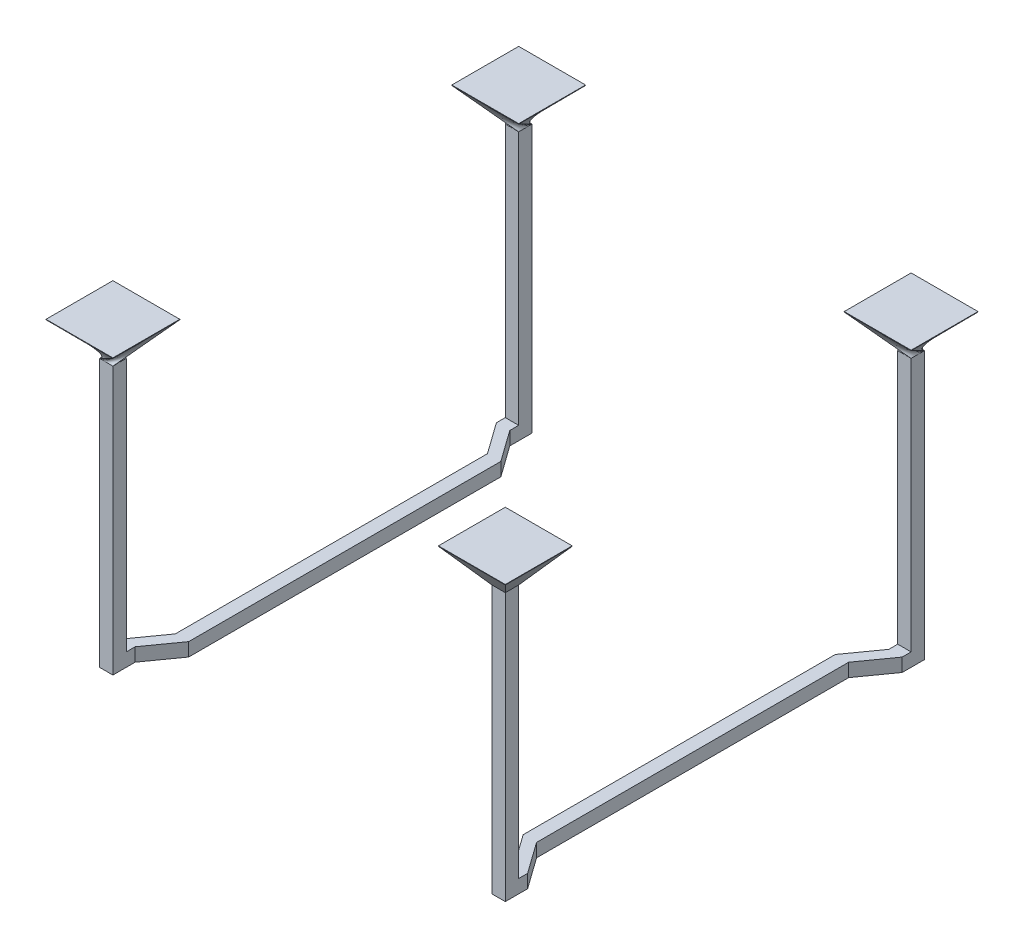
ISO-10303-21;
HEADER;
FILE_DESCRIPTION(('STEP AP214'),'2;1');
FILE_NAME('part.step','',(''),(''),'','','');
FILE_SCHEMA(('AUTOMOTIVE_DESIGN { 1 0 10303 214 1 1 1 1 }'));
ENDSEC;
DATA;
#1=APPLICATION_CONTEXT('core data for automotive mechanical design processes');
#2=APPLICATION_PROTOCOL_DEFINITION('international standard','automotive_design',2000,#1);
#3=PRODUCT_CONTEXT('',#1,'mechanical');
#4=PRODUCT('Part','Part','',(#3));
#5=PRODUCT_RELATED_PRODUCT_CATEGORY('part','',(#4));
#6=PRODUCT_DEFINITION_FORMATION('','',#4);
#7=PRODUCT_DEFINITION_CONTEXT('part definition',#1,'design');
#8=PRODUCT_DEFINITION('design','',#6,#7);
#9=PRODUCT_DEFINITION_SHAPE('','',#8);
#10=(LENGTH_UNIT() NAMED_UNIT(*) SI_UNIT(.MILLI.,.METRE.));
#11=(NAMED_UNIT(*) PLANE_ANGLE_UNIT() SI_UNIT($,.RADIAN.));
#12=(NAMED_UNIT(*) SI_UNIT($,.STERADIAN.) SOLID_ANGLE_UNIT());
#13=UNCERTAINTY_MEASURE_WITH_UNIT(LENGTH_MEASURE(1.E-05),#10,'distance_accuracy_value','');
#14=(GEOMETRIC_REPRESENTATION_CONTEXT(3) GLOBAL_UNCERTAINTY_ASSIGNED_CONTEXT((#13)) GLOBAL_UNIT_ASSIGNED_CONTEXT((#10,
#11,#12)) REPRESENTATION_CONTEXT('',''));
#15=CARTESIAN_POINT('',(0.,0.,0.));
#16=DIRECTION('',(0.,0.,1.));
#17=DIRECTION('',(1.,0.,0.));
#18=AXIS2_PLACEMENT_3D('',#15,#16,#17);
#19=CARTESIAN_POINT('',(221.353696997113,171.704,153.251863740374));
#20=DIRECTION('',(-1.,0.,0.));
#21=DIRECTION('',(0.,0.,1.));
#22=AXIS2_PLACEMENT_3D('',#19,#20,#21);
#23=PLANE('',#22);
#24=DIRECTION('',(0.,0.,1.));
#25=VECTOR('',#24,1.);
#26=CARTESIAN_POINT('',(221.353696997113,171.45,153.251863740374));
#27=LINE('',#26,#25);
#28=CARTESIAN_POINT('',(221.353696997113,171.45,191.351863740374));
#29=VERTEX_POINT('',#28);
#30=CARTESIAN_POINT('',(221.353696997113,171.45,153.251863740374));
#31=VERTEX_POINT('',#30);
#32=EDGE_CURVE('E133',#29,#31,#27,.F.);
#33=ORIENTED_EDGE('',*,*,#32,.T.);
#34=DIRECTION('',(0.,-1.,0.));
#35=VECTOR('',#34,1.);
#36=CARTESIAN_POINT('',(221.353696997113,171.704,153.251863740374));
#37=LINE('',#36,#35);
#38=CARTESIAN_POINT('',(221.353696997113,171.704,153.251863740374));
#39=VERTEX_POINT('',#38);
#40=EDGE_CURVE('E15',#39,#31,#37,.T.);
#41=ORIENTED_EDGE('',*,*,#40,.F.);
#42=DIRECTION('',(0.,0.,-1.));
#43=VECTOR('',#42,1.);
#44=CARTESIAN_POINT('',(221.353696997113,171.704,153.251863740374));
#45=LINE('',#44,#43);
#46=CARTESIAN_POINT('',(221.353696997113,171.704,191.351863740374));
#47=VERTEX_POINT('',#46);
#48=EDGE_CURVE('E159',#47,#39,#45,.T.);
#49=ORIENTED_EDGE('',*,*,#48,.F.);
#50=DIRECTION('',(0.,-1.,0.));
#51=VECTOR('',#50,1.);
#52=CARTESIAN_POINT('',(221.353696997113,171.704,191.351863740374));
#53=LINE('',#52,#51);
#54=EDGE_CURVE('E175',#47,#29,#53,.T.);
#55=ORIENTED_EDGE('',*,*,#54,.T.);
#56=EDGE_LOOP('',(#33,#41,#49,#55));
#57=FACE_BOUND('',#56,.T.);
#58=ADVANCED_FACE('F90',(#57),#23,.F.);
#59=CARTESIAN_POINT('',(183.253696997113,171.704,153.251863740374));
#60=DIRECTION('',(0.,0.,1.));
#61=DIRECTION('',(1.,0.,0.));
#62=AXIS2_PLACEMENT_3D('',#59,#60,#61);
#63=PLANE('',#62);
#64=DIRECTION('',(1.,0.,0.));
#65=VECTOR('',#64,1.);
#66=CARTESIAN_POINT('',(183.253696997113,171.45,153.251863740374));
#67=LINE('',#66,#65);
#68=CARTESIAN_POINT('',(183.253696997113,171.45,153.251863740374));
#69=VERTEX_POINT('',#68);
#70=EDGE_CURVE('E167',#31,#69,#67,.F.);
#71=ORIENTED_EDGE('',*,*,#70,.T.);
#72=DIRECTION('',(0.,-1.,0.));
#73=VECTOR('',#72,1.);
#74=CARTESIAN_POINT('',(183.253696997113,171.704,153.251863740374));
#75=LINE('',#74,#73);
#76=CARTESIAN_POINT('',(183.253696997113,171.704,153.251863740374));
#77=VERTEX_POINT('',#76);
#78=EDGE_CURVE('E99',#77,#69,#75,.T.);
#79=ORIENTED_EDGE('',*,*,#78,.F.);
#80=DIRECTION('',(-1.,0.,0.));
#81=VECTOR('',#80,1.);
#82=CARTESIAN_POINT('',(183.253696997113,171.704,153.251863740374));
#83=LINE('',#82,#81);
#84=EDGE_CURVE('E152',#39,#77,#83,.T.);
#85=ORIENTED_EDGE('',*,*,#84,.F.);
#86=ORIENTED_EDGE('',*,*,#40,.T.);
#87=EDGE_LOOP('',(#71,#79,#85,#86));
#88=FACE_BOUND('',#87,.T.);
#89=ADVANCED_FACE('F165',(#88),#63,.F.);
#90=CARTESIAN_POINT('',(183.253696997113,171.704,153.251863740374));
#91=DIRECTION('',(1.,0.,0.));
#92=DIRECTION('',(0.,0.,-1.));
#93=AXIS2_PLACEMENT_3D('',#90,#91,#92);
#94=PLANE('',#93);
#95=DIRECTION('',(0.,0.,-1.));
#96=VECTOR('',#95,1.);
#97=CARTESIAN_POINT('',(183.253696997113,171.45,153.251863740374));
#98=LINE('',#97,#96);
#99=CARTESIAN_POINT('',(183.253696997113,171.45,191.351863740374));
#100=VERTEX_POINT('',#99);
#101=EDGE_CURVE('E185',#69,#100,#98,.F.);
#102=ORIENTED_EDGE('',*,*,#101,.T.);
#103=DIRECTION('',(0.,-1.,0.));
#104=VECTOR('',#103,1.);
#105=CARTESIAN_POINT('',(183.253696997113,171.704,191.351863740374));
#106=LINE('',#105,#104);
#107=CARTESIAN_POINT('',(183.253696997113,171.704,191.351863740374));
#108=VERTEX_POINT('',#107);
#109=EDGE_CURVE('E170',#108,#100,#106,.T.);
#110=ORIENTED_EDGE('',*,*,#109,.F.);
#111=DIRECTION('',(0.,0.,1.));
#112=VECTOR('',#111,1.);
#113=CARTESIAN_POINT('',(183.253696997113,171.704,153.251863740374));
#114=LINE('',#113,#112);
#115=EDGE_CURVE('E156',#77,#108,#114,.T.);
#116=ORIENTED_EDGE('',*,*,#115,.F.);
#117=ORIENTED_EDGE('',*,*,#78,.T.);
#118=EDGE_LOOP('',(#102,#110,#116,#117));
#119=FACE_BOUND('',#118,.T.);
#120=ADVANCED_FACE('F172',(#119),#94,.F.);
#121=CARTESIAN_POINT('',(183.253696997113,171.704,191.351863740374));
#122=DIRECTION('',(0.,0.,-1.));
#123=DIRECTION('',(-1.,0.,0.));
#124=AXIS2_PLACEMENT_3D('',#121,#122,#123);
#125=PLANE('',#124);
#126=DIRECTION('',(-1.,0.,0.));
#127=VECTOR('',#126,1.);
#128=CARTESIAN_POINT('',(183.253696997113,171.45,191.351863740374));
#129=LINE('',#128,#127);
#130=EDGE_CURVE('E126',#100,#29,#129,.F.);
#131=ORIENTED_EDGE('',*,*,#130,.T.);
#132=ORIENTED_EDGE('',*,*,#54,.F.);
#133=DIRECTION('',(1.,0.,0.));
#134=VECTOR('',#133,1.);
#135=CARTESIAN_POINT('',(183.253696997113,171.704,191.351863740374));
#136=LINE('',#135,#134);
#137=EDGE_CURVE('E108',#108,#47,#136,.T.);
#138=ORIENTED_EDGE('',*,*,#137,.F.);
#139=ORIENTED_EDGE('',*,*,#109,.T.);
#140=EDGE_LOOP('',(#131,#132,#138,#139));
#141=FACE_BOUND('',#140,.T.);
#142=ADVANCED_FACE('F290',(#141),#125,.F.);
#143=CARTESIAN_POINT('',(0.,171.704,0.));
#144=DIRECTION('',(0.,1.,0.));
#145=DIRECTION('',(0.,0.,1.));
#146=AXIS2_PLACEMENT_3D('',#143,#144,#145);
#147=PLANE('',#146);
#148=ORIENTED_EDGE('',*,*,#48,.T.);
#149=ORIENTED_EDGE('',*,*,#84,.T.);
#150=ORIENTED_EDGE('',*,*,#115,.T.);
#151=ORIENTED_EDGE('',*,*,#137,.T.);
#152=EDGE_LOOP('',(#148,#149,#150,#151));
#153=FACE_BOUND('',#152,.T.);
#154=ADVANCED_FACE('F154',(#153),#147,.T.);
#155=CARTESIAN_POINT('',(0.,-26.4350554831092,33.0438193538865));
#156=DIRECTION('',(0.,-0.624695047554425,0.78086880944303));
#157=DIRECTION('',(0.,-0.78086880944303,-0.624695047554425));
#158=AXIS2_PLACEMENT_3D('',#155,#156,#157);
#159=PLANE('',#158);
#160=DIRECTION('',(0.529812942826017,0.662266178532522,0.529812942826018));
#161=VECTOR('',#160,1.);
#162=CARTESIAN_POINT('',(206.113696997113,152.4,176.111863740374));
#163=LINE('',#162,#161);
#164=CARTESIAN_POINT('',(206.113696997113,152.4,176.111863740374));
#165=VERTEX_POINT('',#164);
#166=EDGE_CURVE('E257',#165,#29,#163,.T.);
#167=ORIENTED_EDGE('',*,*,#166,.T.);
#168=ORIENTED_EDGE('',*,*,#130,.F.);
#169=DIRECTION('',(-0.529812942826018,0.662266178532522,0.529812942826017));
#170=VECTOR('',#169,1.);
#171=CARTESIAN_POINT('',(198.493696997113,152.4,176.111863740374));
#172=LINE('',#171,#170);
#173=CARTESIAN_POINT('',(198.493696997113,152.4,176.111863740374));
#174=VERTEX_POINT('',#173);
#175=EDGE_CURVE('E254',#174,#100,#172,.T.);
#176=ORIENTED_EDGE('',*,*,#175,.F.);
#177=DIRECTION('',(1.,0.,0.));
#178=VECTOR('',#177,1.);
#179=CARTESIAN_POINT('',(206.113696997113,152.4,176.111863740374));
#180=LINE('',#179,#178);
#181=EDGE_CURVE('E141',#174,#165,#180,.T.);
#182=ORIENTED_EDGE('',*,*,#181,.T.);
#183=EDGE_LOOP('',(#167,#168,#176,#182));
#184=FACE_BOUND('',#183,.T.);
#185=ADVANCED_FACE('F234',(#184),#159,.T.);
#186=CARTESIAN_POINT('',(195.374205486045,156.299364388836,0.));
#187=DIRECTION('',(-0.78086880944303,-0.624695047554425,0.));
#188=DIRECTION('',(0.624695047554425,-0.78086880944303,0.));
#189=AXIS2_PLACEMENT_3D('',#186,#187,#188);
#190=PLANE('',#189);
#191=ORIENTED_EDGE('',*,*,#175,.T.);
#192=ORIENTED_EDGE('',*,*,#101,.F.);
#193=DIRECTION('',(-0.529812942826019,0.662266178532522,-0.529812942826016));
#194=VECTOR('',#193,1.);
#195=CARTESIAN_POINT('',(198.493696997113,152.4,168.491863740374));
#196=LINE('',#195,#194);
#197=CARTESIAN_POINT('',(198.493696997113,152.4,168.491863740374));
#198=VERTEX_POINT('',#197);
#199=EDGE_CURVE('E183',#198,#69,#196,.T.);
#200=ORIENTED_EDGE('',*,*,#199,.F.);
#201=DIRECTION('',(0.,0.,1.));
#202=VECTOR('',#201,1.);
#203=CARTESIAN_POINT('',(198.493696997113,152.4,176.111863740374));
#204=LINE('',#203,#202);
#205=EDGE_CURVE('E200',#198,#174,#204,.T.);
#206=ORIENTED_EDGE('',*,*,#205,.T.);
#207=EDGE_LOOP('',(#191,#192,#200,#206));
#208=FACE_BOUND('',#207,.T.);
#209=ADVANCED_FACE('F238',(#208),#190,.T.);
#210=CARTESIAN_POINT('',(51.3376201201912,-41.0700960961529,0.));
#211=DIRECTION('',(0.780868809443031,-0.624695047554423,0.));
#212=DIRECTION('',(0.624695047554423,0.780868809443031,0.));
#213=AXIS2_PLACEMENT_3D('',#210,#211,#212);
#214=PLANE('',#213);
#215=DIRECTION('',(0.529812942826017,0.662266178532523,-0.529812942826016));
#216=VECTOR('',#215,1.);
#217=CARTESIAN_POINT('',(206.113696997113,152.4,168.491863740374));
#218=LINE('',#217,#216);
#219=CARTESIAN_POINT('',(206.113696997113,152.4,168.491863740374));
#220=VERTEX_POINT('',#219);
#221=EDGE_CURVE('E256',#220,#31,#218,.T.);
#222=ORIENTED_EDGE('',*,*,#221,.T.);
#223=ORIENTED_EDGE('',*,*,#32,.F.);
#224=ORIENTED_EDGE('',*,*,#166,.F.);
#225=DIRECTION('',(0.,0.,-1.));
#226=VECTOR('',#225,1.);
#227=CARTESIAN_POINT('',(206.113696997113,152.4,163.411863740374));
#228=LINE('',#227,#226);
#229=EDGE_CURVE('E658',#165,#220,#228,.T.);
#230=ORIENTED_EDGE('',*,*,#229,.T.);
#231=EDGE_LOOP('',(#222,#223,#224,#230));
#232=FACE_BOUND('',#231,.T.);
#233=ADVANCED_FACE('F285',(#232),#214,.T.);
#234=CARTESIAN_POINT('',(0.,141.664323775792,177.08040471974));
#235=DIRECTION('',(0.,-0.624695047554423,-0.780868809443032));
#236=DIRECTION('',(0.,0.780868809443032,-0.624695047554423));
#237=AXIS2_PLACEMENT_3D('',#234,#235,#236);
#238=PLANE('',#237);
#239=ORIENTED_EDGE('',*,*,#199,.T.);
#240=ORIENTED_EDGE('',*,*,#70,.F.);
#241=ORIENTED_EDGE('',*,*,#221,.F.);
#242=DIRECTION('',(1.,0.,0.));
#243=VECTOR('',#242,1.);
#244=CARTESIAN_POINT('',(0.,152.4,168.491863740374));
#245=LINE('',#244,#243);
#246=EDGE_CURVE('E674',#198,#220,#245,.T.);
#247=ORIENTED_EDGE('',*,*,#246,.F.);
#248=EDGE_LOOP('',(#239,#240,#241,#247));
#249=FACE_BOUND('',#248,.T.);
#250=ADVANCED_FACE('F232',(#249),#238,.T.);
#251=CARTESIAN_POINT('',(198.493696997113,152.4,-49.948136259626));
#252=DIRECTION('',(0.813733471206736,0.,0.581238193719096));
#253=DIRECTION('',(0.581238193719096,0.,-0.813733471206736));
#254=AXIS2_PLACEMENT_3D('',#251,#252,#253);
#255=PLANE('',#254);
#256=DIRECTION('',(0.,-1.,0.));
#257=VECTOR('',#256,1.);
#258=CARTESIAN_POINT('',(185.793696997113,152.4,-32.168136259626));
#259=LINE('',#258,#257);
#260=CARTESIAN_POINT('',(185.793696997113,7.61999999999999,-32.168136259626));
#261=VERTEX_POINT('',#260);
#262=CARTESIAN_POINT('',(185.793696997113,0.,-32.168136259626));
#263=VERTEX_POINT('',#262);
#264=EDGE_CURVE('E905',#261,#263,#259,.T.);
#265=ORIENTED_EDGE('',*,*,#264,.F.);
#266=DIRECTION('',(0.581238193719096,0.,-0.813733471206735));
#267=VECTOR('',#266,1.);
#268=CARTESIAN_POINT('',(198.493696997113,7.61999999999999,-49.948136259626));
#269=LINE('',#268,#267);
#270=CARTESIAN_POINT('',(198.493696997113,7.62000000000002,-49.948136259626));
#271=VERTEX_POINT('',#270);
#272=EDGE_CURVE('E1002',#261,#271,#269,.T.);
#273=ORIENTED_EDGE('',*,*,#272,.T.);
#274=DIRECTION('',(0.,-1.,0.));
#275=VECTOR('',#274,1.);
#276=CARTESIAN_POINT('',(198.493696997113,152.4,-49.948136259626));
#277=LINE('',#276,#275);
#278=CARTESIAN_POINT('',(198.493696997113,0.,-49.948136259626));
#279=VERTEX_POINT('',#278);
#280=EDGE_CURVE('E737',#271,#279,#277,.T.);
#281=ORIENTED_EDGE('',*,*,#280,.T.);
#282=DIRECTION('',(-0.581238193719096,0.,0.813733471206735));
#283=VECTOR('',#282,1.);
#284=CARTESIAN_POINT('',(198.493696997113,0.,-49.948136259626));
#285=LINE('',#284,#283);
#286=EDGE_CURVE('E883',#279,#263,#285,.T.);
#287=ORIENTED_EDGE('',*,*,#286,.T.);
#288=EDGE_LOOP('',(#265,#273,#281,#287));
#289=FACE_BOUND('',#288,.T.);
#290=ADVANCED_FACE('F228',(#289),#255,.F.);
#291=CARTESIAN_POINT('',(185.793696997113,152.4,-32.168136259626));
#292=DIRECTION('',(1.,0.,0.));
#293=DIRECTION('',(0.,0.,-1.));
#294=AXIS2_PLACEMENT_3D('',#291,#292,#293);
#295=PLANE('',#294);
#296=DIRECTION('',(0.,-1.,0.));
#297=VECTOR('',#296,1.);
#298=CARTESIAN_POINT('',(185.793696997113,152.4,145.631863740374));
#299=LINE('',#298,#297);
#300=CARTESIAN_POINT('',(185.793696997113,7.62000000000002,145.631863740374));
#301=VERTEX_POINT('',#300);
#302=CARTESIAN_POINT('',(185.793696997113,0.,145.631863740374));
#303=VERTEX_POINT('',#302);
#304=EDGE_CURVE('E903',#301,#303,#299,.T.);
#305=ORIENTED_EDGE('',*,*,#304,.F.);
#306=DIRECTION('',(0.,0.,-1.));
#307=VECTOR('',#306,1.);
#308=CARTESIAN_POINT('',(185.793696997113,7.62000000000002,-32.168136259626));
#309=LINE('',#308,#307);
#310=EDGE_CURVE('E1005',#301,#261,#309,.T.);
#311=ORIENTED_EDGE('',*,*,#310,.T.);
#312=ORIENTED_EDGE('',*,*,#264,.T.);
#313=DIRECTION('',(0.,0.,1.));
#314=VECTOR('',#313,1.);
#315=CARTESIAN_POINT('',(185.793696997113,0.,-32.168136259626));
#316=LINE('',#315,#314);
#317=EDGE_CURVE('E1017',#263,#303,#316,.T.);
#318=ORIENTED_EDGE('',*,*,#317,.T.);
#319=EDGE_LOOP('',(#305,#311,#312,#318));
#320=FACE_BOUND('',#319,.T.);
#321=ADVANCED_FACE('F224',(#320),#295,.F.);
#322=CARTESIAN_POINT('',(185.793696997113,152.4,145.631863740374));
#323=DIRECTION('',(0.813733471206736,0.,-0.581238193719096));
#324=DIRECTION('',(-0.581238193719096,0.,-0.813733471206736));
#325=AXIS2_PLACEMENT_3D('',#322,#323,#324);
#326=PLANE('',#325);
#327=DIRECTION('',(0.,-1.,0.));
#328=VECTOR('',#327,1.);
#329=CARTESIAN_POINT('',(198.493696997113,152.4,163.411863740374));
#330=LINE('',#329,#328);
#331=CARTESIAN_POINT('',(198.493696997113,7.61999999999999,163.411863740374));
#332=VERTEX_POINT('',#331);
#333=CARTESIAN_POINT('',(198.493696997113,0.,163.411863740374));
#334=VERTEX_POINT('',#333);
#335=EDGE_CURVE('E190',#332,#334,#330,.T.);
#336=ORIENTED_EDGE('',*,*,#335,.F.);
#337=DIRECTION('',(-0.581238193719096,0.,-0.813733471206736));
#338=VECTOR('',#337,1.);
#339=CARTESIAN_POINT('',(185.793696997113,7.61999999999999,145.631863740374));
#340=LINE('',#339,#338);
#341=EDGE_CURVE('E1008',#332,#301,#340,.T.);
#342=ORIENTED_EDGE('',*,*,#341,.T.);
#343=ORIENTED_EDGE('',*,*,#304,.T.);
#344=DIRECTION('',(0.581238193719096,0.,0.813733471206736));
#345=VECTOR('',#344,1.);
#346=CARTESIAN_POINT('',(185.793696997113,0.,145.631863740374));
#347=LINE('',#346,#345);
#348=EDGE_CURVE('E1020',#303,#334,#347,.T.);
#349=ORIENTED_EDGE('',*,*,#348,.T.);
#350=EDGE_LOOP('',(#336,#342,#343,#349));
#351=FACE_BOUND('',#350,.T.);
#352=ADVANCED_FACE('F219',(#351),#326,.F.);
#353=CARTESIAN_POINT('',(198.493696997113,152.4,176.111863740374));
#354=DIRECTION('',(1.,0.,0.));
#355=DIRECTION('',(0.,0.,-1.));
#356=AXIS2_PLACEMENT_3D('',#353,#354,#355);
#357=PLANE('',#356);
#358=ORIENTED_EDGE('',*,*,#205,.F.);
#359=DIRECTION('',(0.,-1.,0.));
#360=VECTOR('',#359,1.);
#361=CARTESIAN_POINT('',(198.493696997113,152.4,168.491863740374));
#362=LINE('',#361,#360);
#363=CARTESIAN_POINT('',(198.493696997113,7.62,168.491863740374));
#364=VERTEX_POINT('',#363);
#365=EDGE_CURVE('E206',#198,#364,#362,.T.);
#366=ORIENTED_EDGE('',*,*,#365,.T.);
#367=DIRECTION('',(0.,0.,-1.));
#368=VECTOR('',#367,1.);
#369=CARTESIAN_POINT('',(198.493696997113,7.62000000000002,176.111863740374));
#370=LINE('',#369,#368);
#371=EDGE_CURVE('E1011',#364,#332,#370,.T.);
#372=ORIENTED_EDGE('',*,*,#371,.T.);
#373=ORIENTED_EDGE('',*,*,#335,.T.);
#374=DIRECTION('',(0.,0.,1.));
#375=VECTOR('',#374,1.);
#376=CARTESIAN_POINT('',(198.493696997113,0.,176.111863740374));
#377=LINE('',#376,#375);
#378=CARTESIAN_POINT('',(198.493696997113,0.,176.111863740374));
#379=VERTEX_POINT('',#378);
#380=EDGE_CURVE('E1023',#334,#379,#377,.T.);
#381=ORIENTED_EDGE('',*,*,#380,.T.);
#382=DIRECTION('',(0.,-1.,0.));
#383=VECTOR('',#382,1.);
#384=CARTESIAN_POINT('',(198.493696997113,152.4,176.111863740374));
#385=LINE('',#384,#383);
#386=EDGE_CURVE('E188',#174,#379,#385,.T.);
#387=ORIENTED_EDGE('',*,*,#386,.F.);
#388=EDGE_LOOP('',(#358,#366,#372,#373,#381,#387));
#389=FACE_BOUND('',#388,.T.);
#390=ADVANCED_FACE('F208',(#389),#357,.F.);
#391=CARTESIAN_POINT('',(206.113696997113,152.4,176.111863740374));
#392=DIRECTION('',(0.,0.,-1.));
#393=DIRECTION('',(-1.,0.,0.));
#394=AXIS2_PLACEMENT_3D('',#391,#392,#393);
#395=PLANE('',#394);
#396=DIRECTION('',(1.,0.,0.));
#397=VECTOR('',#396,1.);
#398=CARTESIAN_POINT('',(206.113696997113,0.,176.111863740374));
#399=LINE('',#398,#397);
#400=CARTESIAN_POINT('',(206.113696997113,0.,176.111863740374));
#401=VERTEX_POINT('',#400);
#402=EDGE_CURVE('E1025',#379,#401,#399,.T.);
#403=ORIENTED_EDGE('',*,*,#402,.T.);
#404=DIRECTION('',(0.,-1.,0.));
#405=VECTOR('',#404,1.);
#406=CARTESIAN_POINT('',(206.113696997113,152.4,176.111863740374));
#407=LINE('',#406,#405);
#408=EDGE_CURVE('E191',#165,#401,#407,.T.);
#409=ORIENTED_EDGE('',*,*,#408,.F.);
#410=ORIENTED_EDGE('',*,*,#181,.F.);
#411=ORIENTED_EDGE('',*,*,#386,.T.);
#412=EDGE_LOOP('',(#403,#409,#410,#411));
#413=FACE_BOUND('',#412,.T.);
#414=ADVANCED_FACE('F218',(#413),#395,.F.);
#415=CARTESIAN_POINT('',(206.113696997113,152.4,163.411863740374));
#416=DIRECTION('',(-1.,0.,0.));
#417=DIRECTION('',(0.,0.,1.));
#418=AXIS2_PLACEMENT_3D('',#415,#416,#417);
#419=PLANE('',#418);
#420=DIRECTION('',(0.,0.,-1.));
#421=VECTOR('',#420,1.);
#422=CARTESIAN_POINT('',(206.113696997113,7.62,168.491863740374));
#423=LINE('',#422,#421);
#424=CARTESIAN_POINT('',(206.113696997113,7.62,168.491863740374));
#425=VERTEX_POINT('',#424);
#426=CARTESIAN_POINT('',(206.113696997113,7.62,163.411863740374));
#427=VERTEX_POINT('',#426);
#428=EDGE_CURVE('E880',#425,#427,#423,.T.);
#429=ORIENTED_EDGE('',*,*,#428,.F.);
#430=DIRECTION('',(0.,-1.,0.));
#431=VECTOR('',#430,1.);
#432=CARTESIAN_POINT('',(206.113696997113,192.904838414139,168.491863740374));
#433=LINE('',#432,#431);
#434=EDGE_CURVE('E824',#220,#425,#433,.T.);
#435=ORIENTED_EDGE('',*,*,#434,.F.);
#436=ORIENTED_EDGE('',*,*,#229,.F.);
#437=ORIENTED_EDGE('',*,*,#408,.T.);
#438=DIRECTION('',(0.,0.,-1.));
#439=VECTOR('',#438,1.);
#440=CARTESIAN_POINT('',(206.113696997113,0.,163.411863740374));
#441=LINE('',#440,#439);
#442=CARTESIAN_POINT('',(206.113696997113,0.,163.411863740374));
#443=VERTEX_POINT('',#442);
#444=EDGE_CURVE('E1027',#401,#443,#441,.T.);
#445=ORIENTED_EDGE('',*,*,#444,.T.);
#446=DIRECTION('',(0.,-1.,0.));
#447=VECTOR('',#446,1.);
#448=CARTESIAN_POINT('',(206.113696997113,152.4,163.411863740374));
#449=LINE('',#448,#447);
#450=EDGE_CURVE('E895',#427,#443,#449,.T.);
#451=ORIENTED_EDGE('',*,*,#450,.F.);
#452=EDGE_LOOP('',(#429,#435,#436,#437,#445,#451));
#453=FACE_BOUND('',#452,.T.);
#454=ADVANCED_FACE('F381',(#453),#419,.F.);
#455=CARTESIAN_POINT('',(193.413696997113,152.4,145.631863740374));
#456=DIRECTION('',(-0.813733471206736,0.,0.581238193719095));
#457=DIRECTION('',(0.581238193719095,0.,0.813733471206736));
#458=AXIS2_PLACEMENT_3D('',#455,#456,#457);
#459=PLANE('',#458);
#460=DIRECTION('',(0.,-1.,0.));
#461=VECTOR('',#460,1.);
#462=CARTESIAN_POINT('',(193.413696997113,152.4,145.631863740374));
#463=LINE('',#462,#461);
#464=CARTESIAN_POINT('',(193.413696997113,7.62000000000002,145.631863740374));
#465=VERTEX_POINT('',#464);
#466=CARTESIAN_POINT('',(193.413696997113,0.,145.631863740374));
#467=VERTEX_POINT('',#466);
#468=EDGE_CURVE('E887',#465,#467,#463,.T.);
#469=ORIENTED_EDGE('',*,*,#468,.F.);
#470=DIRECTION('',(0.581238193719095,0.,0.813733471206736));
#471=VECTOR('',#470,1.);
#472=CARTESIAN_POINT('',(193.413696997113,7.61999999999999,145.631863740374));
#473=LINE('',#472,#471);
#474=EDGE_CURVE('E878',#465,#427,#473,.T.);
#475=ORIENTED_EDGE('',*,*,#474,.T.);
#476=ORIENTED_EDGE('',*,*,#450,.T.);
#477=DIRECTION('',(-0.581238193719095,0.,-0.813733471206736));
#478=VECTOR('',#477,1.);
#479=CARTESIAN_POINT('',(193.413696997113,0.,145.631863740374));
#480=LINE('',#479,#478);
#481=EDGE_CURVE('E893',#443,#467,#480,.T.);
#482=ORIENTED_EDGE('',*,*,#481,.T.);
#483=EDGE_LOOP('',(#469,#475,#476,#482));
#484=FACE_BOUND('',#483,.T.);
#485=ADVANCED_FACE('F389',(#484),#459,.F.);
#486=CARTESIAN_POINT('',(193.413696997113,152.4,-32.168136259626));
#487=DIRECTION('',(-1.,0.,0.));
#488=DIRECTION('',(0.,0.,1.));
#489=AXIS2_PLACEMENT_3D('',#486,#487,#488);
#490=PLANE('',#489);
#491=DIRECTION('',(0.,-1.,0.));
#492=VECTOR('',#491,1.);
#493=CARTESIAN_POINT('',(193.413696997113,152.4,-32.168136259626));
#494=LINE('',#493,#492);
#495=CARTESIAN_POINT('',(193.413696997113,7.61999999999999,-32.168136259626));
#496=VERTEX_POINT('',#495);
#497=CARTESIAN_POINT('',(193.413696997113,0.,-32.168136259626));
#498=VERTEX_POINT('',#497);
#499=EDGE_CURVE('E889',#496,#498,#494,.T.);
#500=ORIENTED_EDGE('',*,*,#499,.F.);
#501=DIRECTION('',(0.,0.,1.));
#502=VECTOR('',#501,1.);
#503=CARTESIAN_POINT('',(193.413696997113,7.62000000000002,-32.168136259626));
#504=LINE('',#503,#502);
#505=EDGE_CURVE('E875',#496,#465,#504,.T.);
#506=ORIENTED_EDGE('',*,*,#505,.T.);
#507=ORIENTED_EDGE('',*,*,#468,.T.);
#508=DIRECTION('',(0.,0.,-1.));
#509=VECTOR('',#508,1.);
#510=CARTESIAN_POINT('',(193.413696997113,0.,-32.168136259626));
#511=LINE('',#510,#509);
#512=EDGE_CURVE('E1030',#467,#498,#511,.T.);
#513=ORIENTED_EDGE('',*,*,#512,.T.);
#514=EDGE_LOOP('',(#500,#506,#507,#513));
#515=FACE_BOUND('',#514,.T.);
#516=ADVANCED_FACE('F398',(#515),#490,.F.);
#517=CARTESIAN_POINT('',(193.413696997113,152.4,-32.168136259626));
#518=DIRECTION('',(-0.813733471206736,0.,-0.581238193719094));
#519=DIRECTION('',(-0.581238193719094,0.,0.813733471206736));
#520=AXIS2_PLACEMENT_3D('',#517,#518,#519);
#521=PLANE('',#520);
#522=DIRECTION('',(0.,-1.,0.));
#523=VECTOR('',#522,1.);
#524=CARTESIAN_POINT('',(206.113696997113,152.4,-49.948136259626));
#525=LINE('',#524,#523);
#526=CARTESIAN_POINT('',(206.113696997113,7.62,-49.9481362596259));
#527=VERTEX_POINT('',#526);
#528=CARTESIAN_POINT('',(206.113696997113,0.,-49.948136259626));
#529=VERTEX_POINT('',#528);
#530=EDGE_CURVE('E898',#527,#529,#525,.T.);
#531=ORIENTED_EDGE('',*,*,#530,.F.);
#532=DIRECTION('',(-0.581238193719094,0.,0.813733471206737));
#533=VECTOR('',#532,1.);
#534=CARTESIAN_POINT('',(193.413696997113,7.61999999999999,-32.168136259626));
#535=LINE('',#534,#533);
#536=EDGE_CURVE('E890',#527,#496,#535,.T.);
#537=ORIENTED_EDGE('',*,*,#536,.T.);
#538=ORIENTED_EDGE('',*,*,#499,.T.);
#539=DIRECTION('',(0.581238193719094,0.,-0.813733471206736));
#540=VECTOR('',#539,1.);
#541=CARTESIAN_POINT('',(193.413696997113,0.,-32.168136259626));
#542=LINE('',#541,#540);
#543=EDGE_CURVE('E1032',#498,#529,#542,.T.);
#544=ORIENTED_EDGE('',*,*,#543,.T.);
#545=EDGE_LOOP('',(#531,#537,#538,#544));
#546=FACE_BOUND('',#545,.T.);
#547=ADVANCED_FACE('F408',(#546),#521,.F.);
#548=CARTESIAN_POINT('',(206.113696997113,152.4,-62.648136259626));
#549=DIRECTION('',(-1.,0.,0.));
#550=DIRECTION('',(0.,0.,1.));
#551=AXIS2_PLACEMENT_3D('',#548,#549,#550);
#552=PLANE('',#551);
#553=DIRECTION('',(0.,0.,1.));
#554=VECTOR('',#553,1.);
#555=CARTESIAN_POINT('',(206.113696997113,152.4,-62.648136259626));
#556=LINE('',#555,#554);
#557=CARTESIAN_POINT('',(206.113696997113,152.4,-55.028136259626));
#558=VERTEX_POINT('',#557);
#559=CARTESIAN_POINT('',(206.113696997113,152.4,-62.648136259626));
#560=VERTEX_POINT('',#559);
#561=EDGE_CURVE('E754',#558,#560,#556,.F.);
#562=ORIENTED_EDGE('',*,*,#561,.F.);
#563=DIRECTION('',(0.,1.,0.));
#564=VECTOR('',#563,1.);
#565=CARTESIAN_POINT('',(206.113696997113,192.904838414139,-55.028136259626));
#566=LINE('',#565,#564);
#567=CARTESIAN_POINT('',(206.113696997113,7.62,-55.028136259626));
#568=VERTEX_POINT('',#567);
#569=EDGE_CURVE('E912',#568,#558,#566,.T.);
#570=ORIENTED_EDGE('',*,*,#569,.F.);
#571=EDGE_CURVE('E827',#527,#568,#423,.T.);
#572=ORIENTED_EDGE('',*,*,#571,.F.);
#573=ORIENTED_EDGE('',*,*,#530,.T.);
#574=DIRECTION('',(0.,0.,-1.));
#575=VECTOR('',#574,1.);
#576=CARTESIAN_POINT('',(206.113696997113,0.,-62.648136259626));
#577=LINE('',#576,#575);
#578=CARTESIAN_POINT('',(206.113696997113,0.,-62.648136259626));
#579=VERTEX_POINT('',#578);
#580=EDGE_CURVE('E1035',#529,#579,#577,.T.);
#581=ORIENTED_EDGE('',*,*,#580,.T.);
#582=DIRECTION('',(0.,-1.,0.));
#583=VECTOR('',#582,1.);
#584=CARTESIAN_POINT('',(206.113696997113,152.4,-62.648136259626));
#585=LINE('',#584,#583);
#586=EDGE_CURVE('E736',#560,#579,#585,.T.);
#587=ORIENTED_EDGE('',*,*,#586,.F.);
#588=EDGE_LOOP('',(#562,#570,#572,#573,#581,#587));
#589=FACE_BOUND('',#588,.T.);
#590=ADVANCED_FACE('F418',(#589),#552,.F.);
#591=CARTESIAN_POINT('',(198.493696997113,152.4,-62.648136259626));
#592=DIRECTION('',(0.,0.,1.));
#593=DIRECTION('',(1.,0.,0.));
#594=AXIS2_PLACEMENT_3D('',#591,#592,#593);
#595=PLANE('',#594);
#596=DIRECTION('',(-1.,0.,0.));
#597=VECTOR('',#596,1.);
#598=CARTESIAN_POINT('',(198.493696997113,0.,-62.648136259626));
#599=LINE('',#598,#597);
#600=CARTESIAN_POINT('',(198.493696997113,0.,-62.648136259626));
#601=VERTEX_POINT('',#600);
#602=EDGE_CURVE('E733',#579,#601,#599,.T.);
#603=ORIENTED_EDGE('',*,*,#602,.T.);
#604=DIRECTION('',(0.,-1.,0.));
#605=VECTOR('',#604,1.);
#606=CARTESIAN_POINT('',(198.493696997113,152.4,-62.648136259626));
#607=LINE('',#606,#605);
#608=CARTESIAN_POINT('',(198.493696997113,152.4,-62.648136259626));
#609=VERTEX_POINT('',#608);
#610=EDGE_CURVE('E726',#609,#601,#607,.T.);
#611=ORIENTED_EDGE('',*,*,#610,.F.);
#612=DIRECTION('',(1.,0.,0.));
#613=VECTOR('',#612,1.);
#614=CARTESIAN_POINT('',(198.493696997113,152.4,-62.648136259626));
#615=LINE('',#614,#613);
#616=EDGE_CURVE('E730',#560,#609,#615,.F.);
#617=ORIENTED_EDGE('',*,*,#616,.F.);
#618=ORIENTED_EDGE('',*,*,#586,.T.);
#619=EDGE_LOOP('',(#603,#611,#617,#618));
#620=FACE_BOUND('',#619,.T.);
#621=ADVANCED_FACE('F428',(#620),#595,.F.);
#622=CARTESIAN_POINT('',(198.493696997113,152.4,-49.948136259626));
#623=DIRECTION('',(1.,0.,0.));
#624=DIRECTION('',(0.,0.,-1.));
#625=AXIS2_PLACEMENT_3D('',#622,#623,#624);
#626=PLANE('',#625);
#627=DIRECTION('',(0.,0.,-1.));
#628=VECTOR('',#627,1.);
#629=CARTESIAN_POINT('',(198.493696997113,7.62000000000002,-49.948136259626));
#630=LINE('',#629,#628);
#631=CARTESIAN_POINT('',(198.493696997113,7.62,-55.028136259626));
#632=VERTEX_POINT('',#631);
#633=EDGE_CURVE('E907',#271,#632,#630,.T.);
#634=ORIENTED_EDGE('',*,*,#633,.T.);
#635=DIRECTION('',(0.,1.,0.));
#636=VECTOR('',#635,1.);
#637=CARTESIAN_POINT('',(198.493696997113,152.4,-55.028136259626));
#638=LINE('',#637,#636);
#639=CARTESIAN_POINT('',(198.493696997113,152.4,-55.028136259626));
#640=VERTEX_POINT('',#639);
#641=EDGE_CURVE('E743',#632,#640,#638,.T.);
#642=ORIENTED_EDGE('',*,*,#641,.T.);
#643=DIRECTION('',(0.,0.,-1.));
#644=VECTOR('',#643,1.);
#645=CARTESIAN_POINT('',(198.493696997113,152.4,-49.948136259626));
#646=LINE('',#645,#644);
#647=EDGE_CURVE('E740',#609,#640,#646,.F.);
#648=ORIENTED_EDGE('',*,*,#647,.F.);
#649=ORIENTED_EDGE('',*,*,#610,.T.);
#650=DIRECTION('',(0.,0.,1.));
#651=VECTOR('',#650,1.);
#652=CARTESIAN_POINT('',(198.493696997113,0.,-49.948136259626));
#653=LINE('',#652,#651);
#654=EDGE_CURVE('E917',#601,#279,#653,.T.);
#655=ORIENTED_EDGE('',*,*,#654,.T.);
#656=ORIENTED_EDGE('',*,*,#280,.F.);
#657=EDGE_LOOP('',(#634,#642,#648,#649,#655,#656));
#658=FACE_BOUND('',#657,.T.);
#659=ADVANCED_FACE('F438',(#658),#626,.F.);
#660=CARTESIAN_POINT('',(0.,0.,0.));
#661=DIRECTION('',(0.,1.,0.));
#662=DIRECTION('',(0.,0.,1.));
#663=AXIS2_PLACEMENT_3D('',#660,#661,#662);
#664=PLANE('',#663);
#665=ORIENTED_EDGE('',*,*,#286,.F.);
#666=ORIENTED_EDGE('',*,*,#654,.F.);
#667=ORIENTED_EDGE('',*,*,#602,.F.);
#668=ORIENTED_EDGE('',*,*,#580,.F.);
#669=ORIENTED_EDGE('',*,*,#543,.F.);
#670=ORIENTED_EDGE('',*,*,#512,.F.);
#671=ORIENTED_EDGE('',*,*,#481,.F.);
#672=ORIENTED_EDGE('',*,*,#444,.F.);
#673=ORIENTED_EDGE('',*,*,#402,.F.);
#674=ORIENTED_EDGE('',*,*,#380,.F.);
#675=ORIENTED_EDGE('',*,*,#348,.F.);
#676=ORIENTED_EDGE('',*,*,#317,.F.);
#677=EDGE_LOOP('',(#665,#666,#667,#668,#669,#670,#671,#672,#673,#674,#675,#676));
#678=FACE_BOUND('',#677,.T.);
#679=ADVANCED_FACE('F448',(#678),#664,.F.);
#680=CARTESIAN_POINT('',(-25.0263030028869,7.62,168.491863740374));
#681=DIRECTION('',(0.,-1.,0.));
#682=DIRECTION('',(0.,0.,-1.));
#683=AXIS2_PLACEMENT_3D('',#680,#681,#682);
#684=PLANE('',#683);
#685=ORIENTED_EDGE('',*,*,#505,.F.);
#686=ORIENTED_EDGE('',*,*,#536,.F.);
#687=ORIENTED_EDGE('',*,*,#571,.T.);
#688=DIRECTION('',(1.,0.,0.));
#689=VECTOR('',#688,1.);
#690=CARTESIAN_POINT('',(-25.0263030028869,7.62,-55.028136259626));
#691=LINE('',#690,#689);
#692=EDGE_CURVE('E909',#632,#568,#691,.T.);
#693=ORIENTED_EDGE('',*,*,#692,.F.);
#694=ORIENTED_EDGE('',*,*,#633,.F.);
#695=ORIENTED_EDGE('',*,*,#272,.F.);
#696=ORIENTED_EDGE('',*,*,#310,.F.);
#697=ORIENTED_EDGE('',*,*,#341,.F.);
#698=ORIENTED_EDGE('',*,*,#371,.F.);
#699=DIRECTION('',(1.,0.,0.));
#700=VECTOR('',#699,1.);
#701=CARTESIAN_POINT('',(-25.0263030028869,7.62,168.491863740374));
#702=LINE('',#701,#700);
#703=EDGE_CURVE('E914',#364,#425,#702,.T.);
#704=ORIENTED_EDGE('',*,*,#703,.T.);
#705=ORIENTED_EDGE('',*,*,#428,.T.);
#706=ORIENTED_EDGE('',*,*,#474,.F.);
#707=EDGE_LOOP('',(#685,#686,#687,#693,#694,#695,#696,#697,#698,#704,#705,#706));
#708=FACE_BOUND('',#707,.T.);
#709=ADVANCED_FACE('F458',(#708),#684,.F.);
#710=CARTESIAN_POINT('',(-25.0263030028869,192.904838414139,168.491863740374));
#711=DIRECTION('',(0.,0.,1.));
#712=DIRECTION('',(0.,-1.,0.));
#713=AXIS2_PLACEMENT_3D('',#710,#711,#712);
#714=PLANE('',#713);
#715=ORIENTED_EDGE('',*,*,#246,.T.);
#716=ORIENTED_EDGE('',*,*,#434,.T.);
#717=ORIENTED_EDGE('',*,*,#703,.F.);
#718=ORIENTED_EDGE('',*,*,#365,.F.);
#719=EDGE_LOOP('',(#715,#716,#717,#718));
#720=FACE_BOUND('',#719,.T.);
#721=ADVANCED_FACE('F468',(#720),#714,.F.);
#722=CARTESIAN_POINT('',(-25.0263030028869,192.904838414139,-55.028136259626));
#723=DIRECTION('',(0.,0.,-1.));
#724=DIRECTION('',(0.,1.,0.));
#725=AXIS2_PLACEMENT_3D('',#722,#723,#724);
#726=PLANE('',#725);
#727=ORIENTED_EDGE('',*,*,#692,.T.);
#728=ORIENTED_EDGE('',*,*,#569,.T.);
#729=DIRECTION('',(1.,0.,0.));
#730=VECTOR('',#729,1.);
#731=CARTESIAN_POINT('',(-25.0263030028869,152.4,-55.028136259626));
#732=LINE('',#731,#730);
#733=EDGE_CURVE('E831',#558,#640,#732,.F.);
#734=ORIENTED_EDGE('',*,*,#733,.T.);
#735=ORIENTED_EDGE('',*,*,#641,.F.);
#736=EDGE_LOOP('',(#727,#728,#734,#735));
#737=FACE_BOUND('',#736,.T.);
#738=ADVANCED_FACE('F478',(#737),#726,.F.);
#739=CARTESIAN_POINT('',(221.353696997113,171.45,-77.888136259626));
#740=CARTESIAN_POINT('',(198.493696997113,152.4,-62.648136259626));
#741=CARTESIAN_POINT('',(221.353696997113,171.45,-71.5381362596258));
#742=CARTESIAN_POINT('',(199.763696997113,152.4,-62.648136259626));
#743=CARTESIAN_POINT('',(221.353696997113,171.45,-65.1881362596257));
#744=CARTESIAN_POINT('',(201.033696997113,152.4,-62.648136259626));
#745=CARTESIAN_POINT('',(221.353696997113,171.45,-52.4881362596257));
#746=CARTESIAN_POINT('',(203.573696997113,152.4,-62.648136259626));
#747=CARTESIAN_POINT('',(221.353696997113,171.45,-46.1381362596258));
#748=CARTESIAN_POINT('',(204.843696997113,152.4,-62.648136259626));
#749=CARTESIAN_POINT('',(221.353696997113,171.45,-39.788136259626));
#750=CARTESIAN_POINT('',(206.113696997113,152.4,-62.648136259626));
#751=B_SPLINE_SURFACE_WITH_KNOTS('',3,1,((#739,#740),(#741,#742),(#743,#744),(#745,#746),(#747,
#748),(#749,#750)),.UNSPECIFIED.,.F.,.F.,.F.,(4,2,4),(2,2),(0.,0.5,1.),(0.,1.),.UNSPECIFIED.);
#752=DIRECTION('',(0.,0.,-1.));
#753=VECTOR('',#752,1.);
#754=CARTESIAN_POINT('',(221.353696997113,171.45,-77.888136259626));
#755=LINE('',#754,#753);
#756=CARTESIAN_POINT('',(221.353696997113,171.45,-39.788136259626));
#757=VERTEX_POINT('',#756);
#758=CARTESIAN_POINT('',(221.353696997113,171.45,-77.888136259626));
#759=VERTEX_POINT('',#758);
#760=EDGE_CURVE('E769',#757,#759,#755,.T.);
#761=DIRECTION('',(-0.455842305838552,-0.56980288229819,-0.683763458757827));
#762=VECTOR('',#761,1.);
#763=CARTESIAN_POINT('',(213.733696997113,161.925,-51.218136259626));
#764=LINE('',#763,#762);
#765=EDGE_CURVE('E753',#757,#560,#764,.T.);
#766=DIRECTION('',(0.683763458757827,0.56980288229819,-0.455842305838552));
#767=VECTOR('',#766,1.);
#768=CARTESIAN_POINT('',(209.923696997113,161.925,-70.268136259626));
#769=LINE('',#768,#767);
#770=EDGE_CURVE('E751',#609,#759,#769,.T.);
#771=ORIENTED_EDGE('',*,*,#760,.F.);
#772=ORIENTED_EDGE('',*,*,#765,.T.);
#773=ORIENTED_EDGE('',*,*,#616,.T.);
#774=ORIENTED_EDGE('',*,*,#770,.T.);
#775=EDGE_LOOP('',(#771,#772,#773,#774));
#776=FACE_BOUND('',#775,.T.);
#777=ADVANCED_FACE('F488',(#776),#751,.T.);
#778=CARTESIAN_POINT('',(221.353696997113,171.45,-39.788136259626));
#779=CARTESIAN_POINT('',(206.113696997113,152.4,-62.648136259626));
#780=CARTESIAN_POINT('',(215.003696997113,171.45,-39.788136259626));
#781=CARTESIAN_POINT('',(206.113696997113,152.4,-61.378136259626));
#782=CARTESIAN_POINT('',(208.653696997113,171.45,-39.788136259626));
#783=CARTESIAN_POINT('',(206.113696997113,152.4,-60.1081362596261));
#784=CARTESIAN_POINT('',(195.953696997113,171.45,-39.788136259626));
#785=CARTESIAN_POINT('',(206.113696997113,152.4,-57.5681362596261));
#786=CARTESIAN_POINT('',(189.603696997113,171.45,-39.788136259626));
#787=CARTESIAN_POINT('',(206.113696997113,152.4,-56.2981362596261));
#788=CARTESIAN_POINT('',(183.253696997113,171.45,-39.788136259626));
#789=CARTESIAN_POINT('',(206.113696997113,152.4,-55.028136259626));
#790=B_SPLINE_SURFACE_WITH_KNOTS('',3,1,((#778,#779),(#780,#781),(#782,#783),(#784,#785),(#786,
#787),(#788,#789)),.UNSPECIFIED.,.F.,.F.,.F.,(4,2,4),(2,2),(0.,0.5,1.),(0.,1.),.UNSPECIFIED.);
#791=DIRECTION('',(1.,0.,0.));
#792=VECTOR('',#791,1.);
#793=CARTESIAN_POINT('',(183.253696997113,171.45,-39.788136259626));
#794=LINE('',#793,#792);
#795=CARTESIAN_POINT('',(183.253696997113,171.45,-39.788136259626));
#796=VERTEX_POINT('',#795);
#797=EDGE_CURVE('E783',#796,#757,#794,.T.);
#798=DIRECTION('',(0.683763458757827,-0.56980288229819,-0.455842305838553));
#799=VECTOR('',#798,1.);
#800=CARTESIAN_POINT('',(194.683696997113,161.925,-47.408136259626));
#801=LINE('',#800,#799);
#802=EDGE_CURVE('E758',#796,#558,#801,.T.);
#803=ORIENTED_EDGE('',*,*,#797,.F.);
#804=ORIENTED_EDGE('',*,*,#802,.T.);
#805=ORIENTED_EDGE('',*,*,#561,.T.);
#806=ORIENTED_EDGE('',*,*,#765,.F.);
#807=EDGE_LOOP('',(#803,#804,#805,#806));
#808=FACE_BOUND('',#807,.T.);
#809=ADVANCED_FACE('F498',(#808),#790,.T.);
#810=CARTESIAN_POINT('',(183.253696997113,171.45,-77.888136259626));
#811=CARTESIAN_POINT('',(198.493696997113,152.4,-55.028136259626));
#812=CARTESIAN_POINT('',(189.603696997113,171.45,-77.888136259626));
#813=CARTESIAN_POINT('',(198.493696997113,152.4,-56.298136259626));
#814=CARTESIAN_POINT('',(195.953696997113,171.45,-77.888136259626));
#815=CARTESIAN_POINT('',(198.493696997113,152.4,-57.568136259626));
#816=CARTESIAN_POINT('',(208.653696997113,171.45,-77.888136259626));
#817=CARTESIAN_POINT('',(198.493696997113,152.4,-60.108136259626));
#818=CARTESIAN_POINT('',(215.003696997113,171.45,-77.888136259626));
#819=CARTESIAN_POINT('',(198.493696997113,152.4,-61.378136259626));
#820=CARTESIAN_POINT('',(221.353696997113,171.45,-77.888136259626));
#821=CARTESIAN_POINT('',(198.493696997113,152.4,-62.648136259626));
#822=B_SPLINE_SURFACE_WITH_KNOTS('',3,1,((#810,#811),(#812,#813),(#814,#815),(#816,#817),(#818,
#819),(#820,#821)),.UNSPECIFIED.,.F.,.F.,.F.,(4,2,4),(2,2),(0.,0.5,1.),(0.,1.),.UNSPECIFIED.);
#823=DIRECTION('',(-1.,0.,0.));
#824=VECTOR('',#823,1.);
#825=CARTESIAN_POINT('',(183.253696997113,171.45,-77.888136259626));
#826=LINE('',#825,#824);
#827=CARTESIAN_POINT('',(183.253696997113,171.45,-77.888136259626));
#828=VERTEX_POINT('',#827);
#829=EDGE_CURVE('E628',#759,#828,#826,.T.);
#830=DIRECTION('',(0.455842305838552,-0.56980288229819,0.683763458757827));
#831=VECTOR('',#830,1.);
#832=CARTESIAN_POINT('',(190.873696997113,161.925,-66.458136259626));
#833=LINE('',#832,#831);
#834=EDGE_CURVE('E817',#828,#640,#833,.T.);
#835=ORIENTED_EDGE('',*,*,#829,.F.);
#836=ORIENTED_EDGE('',*,*,#770,.F.);
#837=ORIENTED_EDGE('',*,*,#647,.T.);
#838=ORIENTED_EDGE('',*,*,#834,.F.);
#839=EDGE_LOOP('',(#835,#836,#837,#838));
#840=FACE_BOUND('',#839,.T.);
#841=ADVANCED_FACE('F508',(#840),#822,.T.);
#842=CARTESIAN_POINT('',(183.253696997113,171.45,-39.788136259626));
#843=CARTESIAN_POINT('',(206.113696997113,152.4,-55.028136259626));
#844=CARTESIAN_POINT('',(183.253696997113,171.45,-46.138136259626));
#845=CARTESIAN_POINT('',(204.843696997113,152.4,-55.028136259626));
#846=CARTESIAN_POINT('',(183.253696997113,171.45,-52.488136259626));
#847=CARTESIAN_POINT('',(203.573696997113,152.4,-55.028136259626));
#848=CARTESIAN_POINT('',(183.253696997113,171.45,-65.188136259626));
#849=CARTESIAN_POINT('',(201.033696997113,152.4,-55.028136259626));
#850=CARTESIAN_POINT('',(183.253696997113,171.45,-71.538136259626));
#851=CARTESIAN_POINT('',(199.763696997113,152.4,-55.028136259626));
#852=CARTESIAN_POINT('',(183.253696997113,171.45,-77.888136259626));
#853=CARTESIAN_POINT('',(198.493696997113,152.4,-55.028136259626));
#854=B_SPLINE_SURFACE_WITH_KNOTS('',3,1,((#842,#843),(#844,#845),(#846,#847),(#848,#849),(#850,
#851),(#852,#853)),.UNSPECIFIED.,.F.,.F.,.F.,(4,2,4),(2,2),(0.,0.5,1.),(0.,1.),.UNSPECIFIED.);
#855=DIRECTION('',(0.,0.,1.));
#856=VECTOR('',#855,1.);
#857=CARTESIAN_POINT('',(183.253696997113,171.45,-77.888136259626));
#858=LINE('',#857,#856);
#859=EDGE_CURVE('E609',#828,#796,#858,.T.);
#860=ORIENTED_EDGE('',*,*,#859,.F.);
#861=ORIENTED_EDGE('',*,*,#834,.T.);
#862=ORIENTED_EDGE('',*,*,#733,.F.);
#863=ORIENTED_EDGE('',*,*,#802,.F.);
#864=EDGE_LOOP('',(#860,#861,#862,#863));
#865=FACE_BOUND('',#864,.T.);
#866=ADVANCED_FACE('F518',(#865),#854,.T.);
#867=CARTESIAN_POINT('',(221.353696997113,171.704,-77.888136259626));
#868=DIRECTION('',(-1.,0.,0.));
#869=DIRECTION('',(0.,0.,1.));
#870=AXIS2_PLACEMENT_3D('',#867,#868,#869);
#871=PLANE('',#870);
#872=ORIENTED_EDGE('',*,*,#760,.T.);
#873=DIRECTION('',(0.,-1.,0.));
#874=VECTOR('',#873,1.);
#875=CARTESIAN_POINT('',(221.353696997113,171.704,-77.888136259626));
#876=LINE('',#875,#874);
#877=CARTESIAN_POINT('',(221.353696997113,171.704,-77.888136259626));
#878=VERTEX_POINT('',#877);
#879=EDGE_CURVE('E619',#878,#759,#876,.T.);
#880=ORIENTED_EDGE('',*,*,#879,.F.);
#881=DIRECTION('',(0.,0.,-1.));
#882=VECTOR('',#881,1.);
#883=CARTESIAN_POINT('',(221.353696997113,171.704,-77.888136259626));
#884=LINE('',#883,#882);
#885=CARTESIAN_POINT('',(221.353696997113,171.704,-39.788136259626));
#886=VERTEX_POINT('',#885);
#887=EDGE_CURVE('E931',#886,#878,#884,.T.);
#888=ORIENTED_EDGE('',*,*,#887,.F.);
#889=DIRECTION('',(0.,-1.,0.));
#890=VECTOR('',#889,1.);
#891=CARTESIAN_POINT('',(221.353696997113,171.704,-39.788136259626));
#892=LINE('',#891,#890);
#893=EDGE_CURVE('E600',#886,#757,#892,.T.);
#894=ORIENTED_EDGE('',*,*,#893,.T.);
#895=EDGE_LOOP('',(#872,#880,#888,#894));
#896=FACE_BOUND('',#895,.T.);
#897=ADVANCED_FACE('F528',(#896),#871,.F.);
#898=CARTESIAN_POINT('',(183.253696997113,171.704,-77.888136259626));
#899=DIRECTION('',(0.,0.,1.));
#900=DIRECTION('',(1.,0.,0.));
#901=AXIS2_PLACEMENT_3D('',#898,#899,#900);
#902=PLANE('',#901);
#903=ORIENTED_EDGE('',*,*,#829,.T.);
#904=DIRECTION('',(0.,-1.,0.));
#905=VECTOR('',#904,1.);
#906=CARTESIAN_POINT('',(183.253696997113,171.704,-77.888136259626));
#907=LINE('',#906,#905);
#908=CARTESIAN_POINT('',(183.253696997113,171.704,-77.888136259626));
#909=VERTEX_POINT('',#908);
#910=EDGE_CURVE('E599',#909,#828,#907,.T.);
#911=ORIENTED_EDGE('',*,*,#910,.F.);
#912=DIRECTION('',(-1.,0.,0.));
#913=VECTOR('',#912,1.);
#914=CARTESIAN_POINT('',(183.253696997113,171.704,-77.888136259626));
#915=LINE('',#914,#913);
#916=EDGE_CURVE('E926',#878,#909,#915,.T.);
#917=ORIENTED_EDGE('',*,*,#916,.F.);
#918=ORIENTED_EDGE('',*,*,#879,.T.);
#919=EDGE_LOOP('',(#903,#911,#917,#918));
#920=FACE_BOUND('',#919,.T.);
#921=ADVANCED_FACE('F538',(#920),#902,.F.);
#922=CARTESIAN_POINT('',(183.253696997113,171.704,-77.888136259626));
#923=DIRECTION('',(1.,0.,0.));
#924=DIRECTION('',(0.,0.,-1.));
#925=AXIS2_PLACEMENT_3D('',#922,#923,#924);
#926=PLANE('',#925);
#927=ORIENTED_EDGE('',*,*,#859,.T.);
#928=DIRECTION('',(0.,-1.,0.));
#929=VECTOR('',#928,1.);
#930=CARTESIAN_POINT('',(183.253696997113,171.704,-39.788136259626));
#931=LINE('',#930,#929);
#932=CARTESIAN_POINT('',(183.253696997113,171.704,-39.788136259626));
#933=VERTEX_POINT('',#932);
#934=EDGE_CURVE('E591',#933,#796,#931,.T.);
#935=ORIENTED_EDGE('',*,*,#934,.F.);
#936=DIRECTION('',(0.,0.,1.));
#937=VECTOR('',#936,1.);
#938=CARTESIAN_POINT('',(183.253696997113,171.704,-77.888136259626));
#939=LINE('',#938,#937);
#940=EDGE_CURVE('E923',#909,#933,#939,.T.);
#941=ORIENTED_EDGE('',*,*,#940,.F.);
#942=ORIENTED_EDGE('',*,*,#910,.T.);
#943=EDGE_LOOP('',(#927,#935,#941,#942));
#944=FACE_BOUND('',#943,.T.);
#945=ADVANCED_FACE('F548',(#944),#926,.F.);
#946=CARTESIAN_POINT('',(183.253696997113,171.704,-39.788136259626));
#947=DIRECTION('',(0.,0.,-1.));
#948=DIRECTION('',(-1.,0.,0.));
#949=AXIS2_PLACEMENT_3D('',#946,#947,#948);
#950=PLANE('',#949);
#951=ORIENTED_EDGE('',*,*,#797,.T.);
#952=ORIENTED_EDGE('',*,*,#893,.F.);
#953=DIRECTION('',(1.,0.,0.));
#954=VECTOR('',#953,1.);
#955=CARTESIAN_POINT('',(183.253696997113,171.704,-39.788136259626));
#956=LINE('',#955,#954);
#957=EDGE_CURVE('E919',#933,#886,#956,.T.);
#958=ORIENTED_EDGE('',*,*,#957,.F.);
#959=ORIENTED_EDGE('',*,*,#934,.T.);
#960=EDGE_LOOP('',(#951,#952,#958,#959));
#961=FACE_BOUND('',#960,.T.);
#962=ADVANCED_FACE('F558',(#961),#950,.F.);
#963=CARTESIAN_POINT('',(0.,171.704,0.));
#964=DIRECTION('',(0.,1.,0.));
#965=DIRECTION('',(0.,0.,1.));
#966=AXIS2_PLACEMENT_3D('',#963,#964,#965);
#967=PLANE('',#966);
#968=ORIENTED_EDGE('',*,*,#887,.T.);
#969=ORIENTED_EDGE('',*,*,#916,.T.);
#970=ORIENTED_EDGE('',*,*,#940,.T.);
#971=ORIENTED_EDGE('',*,*,#957,.T.);
#972=EDGE_LOOP('',(#968,#969,#970,#971));
#973=FACE_BOUND('',#972,.T.);
#974=ADVANCED_FACE('F568',(#973),#967,.T.);
#975=CLOSED_SHELL('',(#58,#89,#120,#142,#154,#185,#209,#233,#250,#290,#321,#352,#390,#414,#454,
#485,#516,#547,#590,#621,#659,#679,#709,#721,#738,#777,#809,#841,#866,#897,#921,#945,#962,#974));
#976=MANIFOLD_SOLID_BREP('B2',#975);
#977=CARTESIAN_POINT('',(-2.16630300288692,171.704,-77.888136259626));
#978=DIRECTION('',(-1.,0.,0.));
#979=DIRECTION('',(0.,0.,1.));
#980=AXIS2_PLACEMENT_3D('',#977,#978,#979);
#981=PLANE('',#980);
#982=DIRECTION('',(0.,0.,1.));
#983=VECTOR('',#982,1.);
#984=CARTESIAN_POINT('',(-2.16630300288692,171.45,-77.888136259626));
#985=LINE('',#984,#983);
#986=CARTESIAN_POINT('',(-2.16630300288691,171.45,-39.788136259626));
#987=VERTEX_POINT('',#986);
#988=CARTESIAN_POINT('',(-2.16630300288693,171.45,-77.888136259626));
#989=VERTEX_POINT('',#988);
#990=EDGE_CURVE('E1130',#987,#989,#985,.F.);
#991=ORIENTED_EDGE('',*,*,#990,.T.);
#992=DIRECTION('',(0.,-1.,0.));
#993=VECTOR('',#992,1.);
#994=CARTESIAN_POINT('',(-2.16630300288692,171.704,-77.888136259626));
#995=LINE('',#994,#993);
#996=CARTESIAN_POINT('',(-2.16630300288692,171.704,-77.888136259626));
#997=VERTEX_POINT('',#996);
#998=EDGE_CURVE('E88',#997,#989,#995,.T.);
#999=ORIENTED_EDGE('',*,*,#998,.F.);
#1000=DIRECTION('',(0.,0.,-1.));
#1001=VECTOR('',#1000,1.);
#1002=CARTESIAN_POINT('',(-2.16630300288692,171.704,-77.888136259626));
#1003=LINE('',#1002,#1001);
#1004=CARTESIAN_POINT('',(-2.16630300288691,171.704,-39.788136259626));
#1005=VERTEX_POINT('',#1004);
#1006=EDGE_CURVE('E1209',#1005,#997,#1003,.T.);
#1007=ORIENTED_EDGE('',*,*,#1006,.F.);
#1008=DIRECTION('',(0.,-1.,0.));
#1009=VECTOR('',#1008,1.);
#1010=CARTESIAN_POINT('',(-2.16630300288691,171.704,-39.788136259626));
#1011=LINE('',#1010,#1009);
#1012=EDGE_CURVE('E1225',#1005,#987,#1011,.T.);
#1013=ORIENTED_EDGE('',*,*,#1012,.T.);
#1014=EDGE_LOOP('',(#991,#999,#1007,#1013));
#1015=FACE_BOUND('',#1014,.T.);
#1016=ADVANCED_FACE('F1086',(#1015),#981,.F.);
#1017=CARTESIAN_POINT('',(-40.2663030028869,171.704,-77.888136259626));
#1018=DIRECTION('',(0.,0.,1.));
#1019=DIRECTION('',(1.,0.,0.));
#1020=AXIS2_PLACEMENT_3D('',#1017,#1018,#1019);
#1021=PLANE('',#1020);
#1022=DIRECTION('',(1.,0.,0.));
#1023=VECTOR('',#1022,1.);
#1024=CARTESIAN_POINT('',(-40.2663030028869,171.45,-77.888136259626));
#1025=LINE('',#1024,#1023);
#1026=CARTESIAN_POINT('',(-40.2663030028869,171.45,-77.888136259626));
#1027=VERTEX_POINT('',#1026);
#1028=EDGE_CURVE('E1217',#989,#1027,#1025,.F.);
#1029=ORIENTED_EDGE('',*,*,#1028,.T.);
#1030=DIRECTION('',(0.,-1.,0.));
#1031=VECTOR('',#1030,1.);
#1032=CARTESIAN_POINT('',(-40.2663030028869,171.704,-77.888136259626));
#1033=LINE('',#1032,#1031);
#1034=CARTESIAN_POINT('',(-40.2663030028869,171.704,-77.888136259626));
#1035=VERTEX_POINT('',#1034);
#1036=EDGE_CURVE('E1095',#1035,#1027,#1033,.T.);
#1037=ORIENTED_EDGE('',*,*,#1036,.F.);
#1038=DIRECTION('',(-1.,0.,0.));
#1039=VECTOR('',#1038,1.);
#1040=CARTESIAN_POINT('',(-40.2663030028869,171.704,-77.888136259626));
#1041=LINE('',#1040,#1039);
#1042=EDGE_CURVE('E1202',#997,#1035,#1041,.T.);
#1043=ORIENTED_EDGE('',*,*,#1042,.F.);
#1044=ORIENTED_EDGE('',*,*,#998,.T.);
#1045=EDGE_LOOP('',(#1029,#1037,#1043,#1044));
#1046=FACE_BOUND('',#1045,.T.);
#1047=ADVANCED_FACE('F1215',(#1046),#1021,.F.);
#1048=CARTESIAN_POINT('',(-40.2663030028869,171.704,-77.888136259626));
#1049=DIRECTION('',(1.,0.,0.));
#1050=DIRECTION('',(0.,0.,-1.));
#1051=AXIS2_PLACEMENT_3D('',#1048,#1049,#1050);
#1052=PLANE('',#1051);
#1053=DIRECTION('',(0.,0.,-1.));
#1054=VECTOR('',#1053,1.);
#1055=CARTESIAN_POINT('',(-40.2663030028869,171.45,-77.888136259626));
#1056=LINE('',#1055,#1054);
#1057=CARTESIAN_POINT('',(-40.2663030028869,171.45,-39.788136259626));
#1058=VERTEX_POINT('',#1057);
#1059=EDGE_CURVE('E1235',#1027,#1058,#1056,.F.);
#1060=ORIENTED_EDGE('',*,*,#1059,.T.);
#1061=DIRECTION('',(0.,-1.,0.));
#1062=VECTOR('',#1061,1.);
#1063=CARTESIAN_POINT('',(-40.2663030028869,171.704,-39.788136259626));
#1064=LINE('',#1063,#1062);
#1065=CARTESIAN_POINT('',(-40.2663030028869,171.704,-39.788136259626));
#1066=VERTEX_POINT('',#1065);
#1067=EDGE_CURVE('E1220',#1066,#1058,#1064,.T.);
#1068=ORIENTED_EDGE('',*,*,#1067,.F.);
#1069=DIRECTION('',(0.,0.,1.));
#1070=VECTOR('',#1069,1.);
#1071=CARTESIAN_POINT('',(-40.2663030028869,171.704,-77.888136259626));
#1072=LINE('',#1071,#1070);
#1073=EDGE_CURVE('E1206',#1035,#1066,#1072,.T.);
#1074=ORIENTED_EDGE('',*,*,#1073,.F.);
#1075=ORIENTED_EDGE('',*,*,#1036,.T.);
#1076=EDGE_LOOP('',(#1060,#1068,#1074,#1075));
#1077=FACE_BOUND('',#1076,.T.);
#1078=ADVANCED_FACE('F1222',(#1077),#1052,.F.);
#1079=CARTESIAN_POINT('',(-40.2663030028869,171.704,-39.788136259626));
#1080=DIRECTION('',(0.,0.,-1.));
#1081=DIRECTION('',(-1.,0.,0.));
#1082=AXIS2_PLACEMENT_3D('',#1079,#1080,#1081);
#1083=PLANE('',#1082);
#1084=DIRECTION('',(-1.,0.,0.));
#1085=VECTOR('',#1084,1.);
#1086=CARTESIAN_POINT('',(-40.2663030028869,171.45,-39.788136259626));
#1087=LINE('',#1086,#1085);
#1088=EDGE_CURVE('E1123',#1058,#987,#1087,.F.);
#1089=ORIENTED_EDGE('',*,*,#1088,.T.);
#1090=ORIENTED_EDGE('',*,*,#1012,.F.);
#1091=DIRECTION('',(1.,0.,0.));
#1092=VECTOR('',#1091,1.);
#1093=CARTESIAN_POINT('',(-40.2663030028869,171.704,-39.788136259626));
#1094=LINE('',#1093,#1092);
#1095=EDGE_CURVE('E1104',#1066,#1005,#1094,.T.);
#1096=ORIENTED_EDGE('',*,*,#1095,.F.);
#1097=ORIENTED_EDGE('',*,*,#1067,.T.);
#1098=EDGE_LOOP('',(#1089,#1090,#1096,#1097));
#1099=FACE_BOUND('',#1098,.T.);
#1100=ADVANCED_FACE('F1759',(#1099),#1083,.F.);
#1101=CARTESIAN_POINT('',(0.,171.704,0.));
#1102=DIRECTION('',(0.,1.,0.));
#1103=DIRECTION('',(0.,0.,1.));
#1104=AXIS2_PLACEMENT_3D('',#1101,#1102,#1103);
#1105=PLANE('',#1104);
#1106=ORIENTED_EDGE('',*,*,#1006,.T.);
#1107=ORIENTED_EDGE('',*,*,#1042,.T.);
#1108=ORIENTED_EDGE('',*,*,#1073,.T.);
#1109=ORIENTED_EDGE('',*,*,#1095,.T.);
#1110=EDGE_LOOP('',(#1106,#1107,#1108,#1109));
#1111=FACE_BOUND('',#1110,.T.);
#1112=ADVANCED_FACE('F1204',(#1111),#1105,.T.);
#1113=CARTESIAN_POINT('',(-40.2663030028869,171.45,-77.888136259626));
#1114=CARTESIAN_POINT('',(-25.0263030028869,152.4,-55.028136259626));
#1115=CARTESIAN_POINT('',(-33.9163030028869,171.45,-77.888136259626));
#1116=CARTESIAN_POINT('',(-25.0263030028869,152.4,-56.298136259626));
#1117=CARTESIAN_POINT('',(-27.5663030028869,171.45,-77.888136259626));
#1118=CARTESIAN_POINT('',(-25.0263030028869,152.4,-57.568136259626));
#1119=CARTESIAN_POINT('',(-14.8663030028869,171.45,-77.888136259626));
#1120=CARTESIAN_POINT('',(-25.0263030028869,152.4,-60.108136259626));
#1121=CARTESIAN_POINT('',(-8.51630300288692,171.45,-77.888136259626));
#1122=CARTESIAN_POINT('',(-25.0263030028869,152.4,-61.378136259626));
#1123=CARTESIAN_POINT('',(-2.16630300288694,171.45,-77.888136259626));
#1124=CARTESIAN_POINT('',(-25.0263030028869,152.4,-62.648136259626));
#1125=B_SPLINE_SURFACE_WITH_KNOTS('',3,1,((#1113,#1114),(#1115,#1116),(#1117,#1118),(#1119,
#1120),(#1121,#1122),(#1123,#1124)),.UNSPECIFIED.,.F.,.F.,.F.,(4,2,4),(2,2),(0.,0.5,1.),(0.,1.),.UNSPECIFIED.);
#1126=DIRECTION('',(-0.683763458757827,-0.56980288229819,0.455842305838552));
#1127=VECTOR('',#1126,1.);
#1128=CARTESIAN_POINT('',(-13.5963030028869,161.925,-70.268136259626));
#1129=LINE('',#1128,#1127);
#1130=CARTESIAN_POINT('',(-25.0263030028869,152.4,-62.648136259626));
#1131=VERTEX_POINT('',#1130);
#1132=EDGE_CURVE('E1468',#989,#1131,#1129,.T.);
#1133=DIRECTION('',(0.,0.,1.));
#1134=VECTOR('',#1133,1.);
#1135=CARTESIAN_POINT('',(-25.0263030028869,152.4,-49.948136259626));
#1136=LINE('',#1135,#1134);
#1137=CARTESIAN_POINT('',(-25.0263030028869,152.4,-55.028136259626));
#1138=VERTEX_POINT('',#1137);
#1139=EDGE_CURVE('E1408',#1131,#1138,#1136,.T.);
#1140=DIRECTION('',(-0.455842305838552,0.56980288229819,-0.683763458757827));
#1141=VECTOR('',#1140,1.);
#1142=CARTESIAN_POINT('',(-32.6463030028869,161.925,-66.458136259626));
#1143=LINE('',#1142,#1141);
#1144=EDGE_CURVE('E1472',#1138,#1027,#1143,.T.);
#1145=ORIENTED_EDGE('',*,*,#1028,.F.);
#1146=ORIENTED_EDGE('',*,*,#1132,.T.);
#1147=ORIENTED_EDGE('',*,*,#1139,.T.);
#1148=ORIENTED_EDGE('',*,*,#1144,.T.);
#1149=EDGE_LOOP('',(#1145,#1146,#1147,#1148));
#1150=FACE_BOUND('',#1149,.T.);
#1151=ADVANCED_FACE('F1379',(#1150),#1125,.T.);
#1152=CARTESIAN_POINT('',(-2.16630300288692,171.45,-77.888136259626));
#1153=CARTESIAN_POINT('',(-25.0263030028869,152.4,-62.648136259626));
#1154=CARTESIAN_POINT('',(-2.16630300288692,171.45,-71.538136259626));
#1155=CARTESIAN_POINT('',(-23.7563030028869,152.4,-62.648136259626));
#1156=CARTESIAN_POINT('',(-2.16630300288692,171.45,-65.1881362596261));
#1157=CARTESIAN_POINT('',(-22.4863030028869,152.4,-62.648136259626));
#1158=CARTESIAN_POINT('',(-2.16630300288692,171.45,-52.4881362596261));
#1159=CARTESIAN_POINT('',(-19.9463030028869,152.4,-62.648136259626));
#1160=CARTESIAN_POINT('',(-2.16630300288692,171.45,-46.138136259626));
#1161=CARTESIAN_POINT('',(-18.6763030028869,152.4,-62.648136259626));
#1162=CARTESIAN_POINT('',(-2.16630300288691,171.45,-39.788136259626));
#1163=CARTESIAN_POINT('',(-17.4063030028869,152.4,-62.648136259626));
#1164=B_SPLINE_SURFACE_WITH_KNOTS('',3,1,((#1152,#1153),(#1154,#1155),(#1156,#1157),(#1158,
#1159),(#1160,#1161),(#1162,#1163)),.UNSPECIFIED.,.F.,.F.,.F.,(4,2,4),(2,2),(0.,0.5,1.),(0.,1.),.UNSPECIFIED.);
#1165=DIRECTION('',(-0.455842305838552,-0.56980288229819,-0.683763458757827));
#1166=VECTOR('',#1165,1.);
#1167=CARTESIAN_POINT('',(-9.78630300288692,161.925,-51.218136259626));
#1168=LINE('',#1167,#1166);
#1169=CARTESIAN_POINT('',(-17.4063030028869,152.4,-62.648136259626));
#1170=VERTEX_POINT('',#1169);
#1171=EDGE_CURVE('E1464',#987,#1170,#1168,.T.);
#1172=DIRECTION('',(-1.,0.,0.));
#1173=VECTOR('',#1172,1.);
#1174=CARTESIAN_POINT('',(-25.0263030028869,152.4,-62.648136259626));
#1175=LINE('',#1174,#1173);
#1176=EDGE_CURVE('E1233',#1170,#1131,#1175,.T.);
#1177=ORIENTED_EDGE('',*,*,#990,.F.);
#1178=ORIENTED_EDGE('',*,*,#1171,.T.);
#1179=ORIENTED_EDGE('',*,*,#1176,.T.);
#1180=ORIENTED_EDGE('',*,*,#1132,.F.);
#1181=EDGE_LOOP('',(#1177,#1178,#1179,#1180));
#1182=FACE_BOUND('',#1181,.T.);
#1183=ADVANCED_FACE('F1385',(#1182),#1164,.T.);
#1184=CARTESIAN_POINT('',(-40.2663030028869,171.45,-39.788136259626));
#1185=CARTESIAN_POINT('',(-17.4063030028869,152.4,-55.028136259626));
#1186=CARTESIAN_POINT('',(-40.2663030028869,171.45,-46.138136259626));
#1187=CARTESIAN_POINT('',(-18.6763030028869,152.4,-55.028136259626));
#1188=CARTESIAN_POINT('',(-40.2663030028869,171.45,-52.488136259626));
#1189=CARTESIAN_POINT('',(-19.9463030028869,152.4,-55.028136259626));
#1190=CARTESIAN_POINT('',(-40.2663030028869,171.45,-65.188136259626));
#1191=CARTESIAN_POINT('',(-22.4863030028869,152.4,-55.028136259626));
#1192=CARTESIAN_POINT('',(-40.2663030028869,171.45,-71.538136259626));
#1193=CARTESIAN_POINT('',(-23.7563030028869,152.4,-55.028136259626));
#1194=CARTESIAN_POINT('',(-40.2663030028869,171.45,-77.888136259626));
#1195=CARTESIAN_POINT('',(-25.0263030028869,152.4,-55.028136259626));
#1196=B_SPLINE_SURFACE_WITH_KNOTS('',3,1,((#1184,#1185),(#1186,#1187),(#1188,#1189),(#1190,
#1191),(#1192,#1193),(#1194,#1195)),.UNSPECIFIED.,.F.,.F.,.F.,(4,2,4),(2,2),(0.,0.5,1.),(0.,1.),.UNSPECIFIED.);
#1197=DIRECTION('',(1.,0.,0.));
#1198=VECTOR('',#1197,1.);
#1199=CARTESIAN_POINT('',(0.,152.4,-55.028136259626));
#1200=LINE('',#1199,#1198);
#1201=CARTESIAN_POINT('',(-17.4063030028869,152.4,-55.028136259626));
#1202=VERTEX_POINT('',#1201);
#1203=EDGE_CURVE('E1251',#1138,#1202,#1200,.T.);
#1204=DIRECTION('',(0.683763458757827,-0.56980288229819,-0.455842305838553));
#1205=VECTOR('',#1204,1.);
#1206=CARTESIAN_POINT('',(-28.8363030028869,161.925,-47.408136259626));
#1207=LINE('',#1206,#1205);
#1208=EDGE_CURVE('E1462',#1058,#1202,#1207,.T.);
#1209=ORIENTED_EDGE('',*,*,#1059,.F.);
#1210=ORIENTED_EDGE('',*,*,#1144,.F.);
#1211=ORIENTED_EDGE('',*,*,#1203,.T.);
#1212=ORIENTED_EDGE('',*,*,#1208,.F.);
#1213=EDGE_LOOP('',(#1209,#1210,#1211,#1212));
#1214=FACE_BOUND('',#1213,.T.);
#1215=ADVANCED_FACE('F1414',(#1214),#1196,.T.);
#1216=CARTESIAN_POINT('',(-2.16630300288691,171.45,-39.788136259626));
#1217=CARTESIAN_POINT('',(-17.4063030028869,152.4,-62.648136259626));
#1218=CARTESIAN_POINT('',(-8.51630300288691,171.45,-39.788136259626));
#1219=CARTESIAN_POINT('',(-17.4063030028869,152.4,-61.378136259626));
#1220=CARTESIAN_POINT('',(-14.8663030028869,171.45,-39.788136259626));
#1221=CARTESIAN_POINT('',(-17.4063030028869,152.4,-60.108136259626));
#1222=CARTESIAN_POINT('',(-27.5663030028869,171.45,-39.788136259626));
#1223=CARTESIAN_POINT('',(-17.4063030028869,152.4,-57.568136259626));
#1224=CARTESIAN_POINT('',(-33.9163030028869,171.45,-39.788136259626));
#1225=CARTESIAN_POINT('',(-17.4063030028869,152.4,-56.298136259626));
#1226=CARTESIAN_POINT('',(-40.2663030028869,171.45,-39.788136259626));
#1227=CARTESIAN_POINT('',(-17.4063030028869,152.4,-55.028136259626));
#1228=B_SPLINE_SURFACE_WITH_KNOTS('',3,1,((#1216,#1217),(#1218,#1219),(#1220,#1221),(#1222,
#1223),(#1224,#1225),(#1226,#1227)),.UNSPECIFIED.,.F.,.F.,.F.,(4,2,4),(2,2),(0.,0.5,1.),(0.,1.),.UNSPECIFIED.);
#1229=DIRECTION('',(0.,0.,-1.));
#1230=VECTOR('',#1229,1.);
#1231=CARTESIAN_POINT('',(-17.4063030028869,152.4,-62.648136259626));
#1232=LINE('',#1231,#1230);
#1233=EDGE_CURVE('E1328',#1202,#1170,#1232,.T.);
#1234=ORIENTED_EDGE('',*,*,#1088,.F.);
#1235=ORIENTED_EDGE('',*,*,#1208,.T.);
#1236=ORIENTED_EDGE('',*,*,#1233,.T.);
#1237=ORIENTED_EDGE('',*,*,#1171,.F.);
#1238=EDGE_LOOP('',(#1234,#1235,#1236,#1237));
#1239=FACE_BOUND('',#1238,.T.);
#1240=ADVANCED_FACE('F1377',(#1239),#1228,.T.);
#1241=CARTESIAN_POINT('',(-12.3263030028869,152.4,-32.168136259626));
#1242=DIRECTION('',(0.813733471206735,0.,-0.581238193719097));
#1243=DIRECTION('',(-0.581238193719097,0.,-0.813733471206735));
#1244=AXIS2_PLACEMENT_3D('',#1241,#1242,#1243);
#1245=PLANE('',#1244);
#1246=DIRECTION('',(0.,-1.,0.));
#1247=VECTOR('',#1246,1.);
#1248=CARTESIAN_POINT('',(-12.3263030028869,152.4,-32.168136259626));
#1249=LINE('',#1248,#1247);
#1250=CARTESIAN_POINT('',(-12.3263030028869,7.62000000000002,-32.168136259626));
#1251=VERTEX_POINT('',#1250);
#1252=CARTESIAN_POINT('',(-12.3263030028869,0.,-32.168136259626));
#1253=VERTEX_POINT('',#1252);
#1254=EDGE_CURVE('E1649',#1251,#1253,#1249,.T.);
#1255=ORIENTED_EDGE('',*,*,#1254,.F.);
#1256=DIRECTION('',(-0.581238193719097,0.,-0.813733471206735));
#1257=VECTOR('',#1256,1.);
#1258=CARTESIAN_POINT('',(-12.3263030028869,7.61999999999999,-32.168136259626));
#1259=LINE('',#1258,#1257);
#1260=CARTESIAN_POINT('',(-25.0263030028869,7.62,-49.9481362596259));
#1261=VERTEX_POINT('',#1260);
#1262=EDGE_CURVE('E1598',#1251,#1261,#1259,.T.);
#1263=ORIENTED_EDGE('',*,*,#1262,.T.);
#1264=DIRECTION('',(0.,-1.,0.));
#1265=VECTOR('',#1264,1.);
#1266=CARTESIAN_POINT('',(-25.0263030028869,152.4,-49.948136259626));
#1267=LINE('',#1266,#1265);
#1268=CARTESIAN_POINT('',(-25.0263030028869,0.,-49.948136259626));
#1269=VERTEX_POINT('',#1268);
#1270=EDGE_CURVE('E1307',#1261,#1269,#1267,.T.);
#1271=ORIENTED_EDGE('',*,*,#1270,.T.);
#1272=DIRECTION('',(0.581238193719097,0.,0.813733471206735));
#1273=VECTOR('',#1272,1.);
#1274=CARTESIAN_POINT('',(-12.3263030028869,0.,-32.168136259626));
#1275=LINE('',#1274,#1273);
#1276=EDGE_CURVE('E1601',#1269,#1253,#1275,.T.);
#1277=ORIENTED_EDGE('',*,*,#1276,.T.);
#1278=EDGE_LOOP('',(#1255,#1263,#1271,#1277));
#1279=FACE_BOUND('',#1278,.T.);
#1280=ADVANCED_FACE('F1373',(#1279),#1245,.F.);
#1281=CARTESIAN_POINT('',(-12.3263030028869,152.4,-32.168136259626));
#1282=DIRECTION('',(1.,0.,0.));
#1283=DIRECTION('',(0.,0.,-1.));
#1284=AXIS2_PLACEMENT_3D('',#1281,#1282,#1283);
#1285=PLANE('',#1284);
#1286=DIRECTION('',(0.,-1.,0.));
#1287=VECTOR('',#1286,1.);
#1288=CARTESIAN_POINT('',(-12.3263030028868,152.4,145.631863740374));
#1289=LINE('',#1288,#1287);
#1290=CARTESIAN_POINT('',(-12.3263030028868,7.61999999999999,145.631863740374));
#1291=VERTEX_POINT('',#1290);
#1292=CARTESIAN_POINT('',(-12.3263030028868,0.,145.631863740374));
#1293=VERTEX_POINT('',#1292);
#1294=EDGE_CURVE('E1646',#1291,#1293,#1289,.T.);
#1295=ORIENTED_EDGE('',*,*,#1294,.F.);
#1296=DIRECTION('',(0.,0.,-1.));
#1297=VECTOR('',#1296,1.);
#1298=CARTESIAN_POINT('',(-12.3263030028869,7.62000000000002,-32.168136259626));
#1299=LINE('',#1298,#1297);
#1300=EDGE_CURVE('E1595',#1291,#1251,#1299,.T.);
#1301=ORIENTED_EDGE('',*,*,#1300,.T.);
#1302=ORIENTED_EDGE('',*,*,#1254,.T.);
#1303=DIRECTION('',(0.,0.,1.));
#1304=VECTOR('',#1303,1.);
#1305=CARTESIAN_POINT('',(-12.3263030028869,0.,-32.168136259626));
#1306=LINE('',#1305,#1304);
#1307=EDGE_CURVE('E1604',#1253,#1293,#1306,.T.);
#1308=ORIENTED_EDGE('',*,*,#1307,.T.);
#1309=EDGE_LOOP('',(#1295,#1301,#1302,#1308));
#1310=FACE_BOUND('',#1309,.T.);
#1311=ADVANCED_FACE('F1369',(#1310),#1285,.F.);
#1312=CARTESIAN_POINT('',(-12.3263030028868,152.4,145.631863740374));
#1313=DIRECTION('',(0.813733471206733,0.,0.581238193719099));
#1314=DIRECTION('',(0.581238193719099,0.,-0.813733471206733));
#1315=AXIS2_PLACEMENT_3D('',#1312,#1313,#1314);
#1316=PLANE('',#1315);
#1317=DIRECTION('',(0.,-1.,0.));
#1318=VECTOR('',#1317,1.);
#1319=CARTESIAN_POINT('',(-25.0263030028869,152.4,163.411863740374));
#1320=LINE('',#1319,#1318);
#1321=CARTESIAN_POINT('',(-25.0263030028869,7.62,163.411863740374));
#1322=VERTEX_POINT('',#1321);
#1323=CARTESIAN_POINT('',(-25.0263030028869,0.,163.411863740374));
#1324=VERTEX_POINT('',#1323);
#1325=EDGE_CURVE('E1644',#1322,#1324,#1320,.T.);
#1326=ORIENTED_EDGE('',*,*,#1325,.F.);
#1327=DIRECTION('',(0.581238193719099,0.,-0.813733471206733));
#1328=VECTOR('',#1327,1.);
#1329=CARTESIAN_POINT('',(-12.3263030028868,7.61999999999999,145.631863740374));
#1330=LINE('',#1329,#1328);
#1331=EDGE_CURVE('E1592',#1322,#1291,#1330,.T.);
#1332=ORIENTED_EDGE('',*,*,#1331,.T.);
#1333=ORIENTED_EDGE('',*,*,#1294,.T.);
#1334=DIRECTION('',(-0.581238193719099,0.,0.813733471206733));
#1335=VECTOR('',#1334,1.);
#1336=CARTESIAN_POINT('',(-12.3263030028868,0.,145.631863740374));
#1337=LINE('',#1336,#1335);
#1338=EDGE_CURVE('E1607',#1293,#1324,#1337,.T.);
#1339=ORIENTED_EDGE('',*,*,#1338,.T.);
#1340=EDGE_LOOP('',(#1326,#1332,#1333,#1339));
#1341=FACE_BOUND('',#1340,.T.);
#1342=ADVANCED_FACE('F1365',(#1341),#1316,.F.);
#1343=CARTESIAN_POINT('',(-25.0263030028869,152.4,163.411863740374));
#1344=DIRECTION('',(1.,0.,0.));
#1345=DIRECTION('',(0.,0.,-1.));
#1346=AXIS2_PLACEMENT_3D('',#1343,#1344,#1345);
#1347=PLANE('',#1346);
#1348=DIRECTION('',(0.,0.,-1.));
#1349=VECTOR('',#1348,1.);
#1350=CARTESIAN_POINT('',(-25.0263030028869,152.4,163.411863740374));
#1351=LINE('',#1350,#1349);
#1352=CARTESIAN_POINT('',(-25.0263030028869,152.4,168.491863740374));
#1353=VERTEX_POINT('',#1352);
#1354=CARTESIAN_POINT('',(-25.0263030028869,152.4,176.111863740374));
#1355=VERTEX_POINT('',#1354);
#1356=EDGE_CURVE('E1633',#1353,#1355,#1351,.F.);
#1357=ORIENTED_EDGE('',*,*,#1356,.F.);
#1358=DIRECTION('',(0.,-1.,0.));
#1359=VECTOR('',#1358,1.);
#1360=CARTESIAN_POINT('',(-25.0263030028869,192.904838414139,168.491863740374));
#1361=LINE('',#1360,#1359);
#1362=CARTESIAN_POINT('',(-25.0263030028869,7.62,168.491863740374));
#1363=VERTEX_POINT('',#1362);
#1364=EDGE_CURVE('E1655',#1353,#1363,#1361,.T.);
#1365=ORIENTED_EDGE('',*,*,#1364,.T.);
#1366=DIRECTION('',(0.,0.,-1.));
#1367=VECTOR('',#1366,1.);
#1368=CARTESIAN_POINT('',(-25.0263030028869,7.62,168.491863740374));
#1369=LINE('',#1368,#1367);
#1370=EDGE_CURVE('E1563',#1363,#1322,#1369,.T.);
#1371=ORIENTED_EDGE('',*,*,#1370,.T.);
#1372=ORIENTED_EDGE('',*,*,#1325,.T.);
#1373=DIRECTION('',(0.,0.,1.));
#1374=VECTOR('',#1373,1.);
#1375=CARTESIAN_POINT('',(-25.0263030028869,0.,163.411863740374));
#1376=LINE('',#1375,#1374);
#1377=CARTESIAN_POINT('',(-25.0263030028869,0.,176.111863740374));
#1378=VERTEX_POINT('',#1377);
#1379=EDGE_CURVE('E1610',#1324,#1378,#1376,.T.);
#1380=ORIENTED_EDGE('',*,*,#1379,.T.);
#1381=DIRECTION('',(0.,-1.,0.));
#1382=VECTOR('',#1381,1.);
#1383=CARTESIAN_POINT('',(-25.0263030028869,152.4,176.111863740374));
#1384=LINE('',#1383,#1382);
#1385=EDGE_CURVE('E1647',#1355,#1378,#1384,.T.);
#1386=ORIENTED_EDGE('',*,*,#1385,.F.);
#1387=EDGE_LOOP('',(#1357,#1365,#1371,#1372,#1380,#1386));
#1388=FACE_BOUND('',#1387,.T.);
#1389=ADVANCED_FACE('F1361',(#1388),#1347,.F.);
#1390=CARTESIAN_POINT('',(-25.0263030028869,152.4,176.111863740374));
#1391=DIRECTION('',(0.,0.,-1.));
#1392=DIRECTION('',(-1.,0.,0.));
#1393=AXIS2_PLACEMENT_3D('',#1390,#1391,#1392);
#1394=PLANE('',#1393);
#1395=DIRECTION('',(1.,0.,0.));
#1396=VECTOR('',#1395,1.);
#1397=CARTESIAN_POINT('',(-25.0263030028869,0.,176.111863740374));
#1398=LINE('',#1397,#1396);
#1399=CARTESIAN_POINT('',(-17.4063030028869,0.,176.111863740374));
#1400=VERTEX_POINT('',#1399);
#1401=EDGE_CURVE('E1612',#1378,#1400,#1398,.T.);
#1402=ORIENTED_EDGE('',*,*,#1401,.T.);
#1403=DIRECTION('',(0.,-1.,0.));
#1404=VECTOR('',#1403,1.);
#1405=CARTESIAN_POINT('',(-17.4063030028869,152.4,176.111863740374));
#1406=LINE('',#1405,#1404);
#1407=CARTESIAN_POINT('',(-17.4063030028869,152.4,176.111863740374));
#1408=VERTEX_POINT('',#1407);
#1409=EDGE_CURVE('E1643',#1408,#1400,#1406,.T.);
#1410=ORIENTED_EDGE('',*,*,#1409,.F.);
#1411=DIRECTION('',(-1.,0.,0.));
#1412=VECTOR('',#1411,1.);
#1413=CARTESIAN_POINT('',(-25.0263030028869,152.4,176.111863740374));
#1414=LINE('',#1413,#1412);
#1415=EDGE_CURVE('E1662',#1355,#1408,#1414,.F.);
#1416=ORIENTED_EDGE('',*,*,#1415,.F.);
#1417=ORIENTED_EDGE('',*,*,#1385,.T.);
#1418=EDGE_LOOP('',(#1402,#1410,#1416,#1417));
#1419=FACE_BOUND('',#1418,.T.);
#1420=ADVANCED_FACE('F1357',(#1419),#1394,.F.);
#1421=CARTESIAN_POINT('',(-17.4063030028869,152.4,176.111863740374));
#1422=DIRECTION('',(-1.,0.,0.));
#1423=DIRECTION('',(0.,0.,1.));
#1424=AXIS2_PLACEMENT_3D('',#1421,#1422,#1423);
#1425=PLANE('',#1424);
#1426=DIRECTION('',(0.,0.,1.));
#1427=VECTOR('',#1426,1.);
#1428=CARTESIAN_POINT('',(-17.4063030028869,7.62000000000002,176.111863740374));
#1429=LINE('',#1428,#1427);
#1430=CARTESIAN_POINT('',(-17.4063030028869,7.61999999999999,163.411863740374));
#1431=VERTEX_POINT('',#1430);
#1432=CARTESIAN_POINT('',(-17.4063030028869,7.62,168.491863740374));
#1433=VERTEX_POINT('',#1432);
#1434=EDGE_CURVE('E1589',#1431,#1433,#1429,.T.);
#1435=ORIENTED_EDGE('',*,*,#1434,.T.);
#1436=DIRECTION('',(0.,1.,0.));
#1437=VECTOR('',#1436,1.);
#1438=CARTESIAN_POINT('',(-17.4063030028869,152.4,168.491863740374));
#1439=LINE('',#1438,#1437);
#1440=CARTESIAN_POINT('',(-17.4063030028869,152.4,168.491863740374));
#1441=VERTEX_POINT('',#1440);
#1442=EDGE_CURVE('E1241',#1433,#1441,#1439,.T.);
#1443=ORIENTED_EDGE('',*,*,#1442,.T.);
#1444=DIRECTION('',(0.,0.,1.));
#1445=VECTOR('',#1444,1.);
#1446=CARTESIAN_POINT('',(-17.4063030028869,152.4,176.111863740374));
#1447=LINE('',#1446,#1445);
#1448=EDGE_CURVE('E1635',#1408,#1441,#1447,.F.);
#1449=ORIENTED_EDGE('',*,*,#1448,.F.);
#1450=ORIENTED_EDGE('',*,*,#1409,.T.);
#1451=DIRECTION('',(0.,0.,-1.));
#1452=VECTOR('',#1451,1.);
#1453=CARTESIAN_POINT('',(-17.4063030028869,0.,176.111863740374));
#1454=LINE('',#1453,#1452);
#1455=CARTESIAN_POINT('',(-17.4063030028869,0.,163.411863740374));
#1456=VERTEX_POINT('',#1455);
#1457=EDGE_CURVE('E1614',#1400,#1456,#1454,.T.);
#1458=ORIENTED_EDGE('',*,*,#1457,.T.);
#1459=DIRECTION('',(0.,-1.,0.));
#1460=VECTOR('',#1459,1.);
#1461=CARTESIAN_POINT('',(-17.4063030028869,152.4,163.411863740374));
#1462=LINE('',#1461,#1460);
#1463=EDGE_CURVE('E1641',#1431,#1456,#1462,.T.);
#1464=ORIENTED_EDGE('',*,*,#1463,.F.);
#1465=EDGE_LOOP('',(#1435,#1443,#1449,#1450,#1458,#1464));
#1466=FACE_BOUND('',#1465,.T.);
#1467=ADVANCED_FACE('F1353',(#1466),#1425,.F.);
#1468=CARTESIAN_POINT('',(-17.4063030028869,152.4,163.411863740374));
#1469=DIRECTION('',(-0.813733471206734,0.,-0.581238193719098));
#1470=DIRECTION('',(-0.581238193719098,0.,0.813733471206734));
#1471=AXIS2_PLACEMENT_3D('',#1468,#1469,#1470);
#1472=PLANE('',#1471);
#1473=DIRECTION('',(0.,-1.,0.));
#1474=VECTOR('',#1473,1.);
#1475=CARTESIAN_POINT('',(-4.70630300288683,152.4,145.631863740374));
#1476=LINE('',#1475,#1474);
#1477=CARTESIAN_POINT('',(-4.70630300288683,7.62000000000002,145.631863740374));
#1478=VERTEX_POINT('',#1477);
#1479=CARTESIAN_POINT('',(-4.70630300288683,0.,145.631863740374));
#1480=VERTEX_POINT('',#1479);
#1481=EDGE_CURVE('E1639',#1478,#1480,#1476,.T.);
#1482=ORIENTED_EDGE('',*,*,#1481,.F.);
#1483=DIRECTION('',(-0.581238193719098,0.,0.813733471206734));
#1484=VECTOR('',#1483,1.);
#1485=CARTESIAN_POINT('',(-17.4063030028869,7.61999999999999,163.411863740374));
#1486=LINE('',#1485,#1484);
#1487=EDGE_CURVE('E1586',#1478,#1431,#1486,.T.);
#1488=ORIENTED_EDGE('',*,*,#1487,.T.);
#1489=ORIENTED_EDGE('',*,*,#1463,.T.);
#1490=DIRECTION('',(0.581238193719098,0.,-0.813733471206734));
#1491=VECTOR('',#1490,1.);
#1492=CARTESIAN_POINT('',(-17.4063030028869,0.,163.411863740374));
#1493=LINE('',#1492,#1491);
#1494=EDGE_CURVE('E1617',#1456,#1480,#1493,.T.);
#1495=ORIENTED_EDGE('',*,*,#1494,.T.);
#1496=EDGE_LOOP('',(#1482,#1488,#1489,#1495));
#1497=FACE_BOUND('',#1496,.T.);
#1498=ADVANCED_FACE('F1349',(#1497),#1472,.F.);
#1499=CARTESIAN_POINT('',(-4.70630300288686,152.4,-32.168136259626));
#1500=DIRECTION('',(-1.,0.,0.));
#1501=DIRECTION('',(0.,0.,1.));
#1502=AXIS2_PLACEMENT_3D('',#1499,#1500,#1501);
#1503=PLANE('',#1502);
#1504=DIRECTION('',(0.,-1.,0.));
#1505=VECTOR('',#1504,1.);
#1506=CARTESIAN_POINT('',(-4.70630300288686,152.4,-32.168136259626));
#1507=LINE('',#1506,#1505);
#1508=CARTESIAN_POINT('',(-4.70630300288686,7.61999999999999,-32.168136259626));
#1509=VERTEX_POINT('',#1508);
#1510=CARTESIAN_POINT('',(-4.70630300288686,0.,-32.168136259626));
#1511=VERTEX_POINT('',#1510);
#1512=EDGE_CURVE('E1637',#1509,#1511,#1507,.T.);
#1513=ORIENTED_EDGE('',*,*,#1512,.F.);
#1514=DIRECTION('',(0.,0.,1.));
#1515=VECTOR('',#1514,1.);
#1516=CARTESIAN_POINT('',(-4.70630300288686,7.62000000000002,-32.168136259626));
#1517=LINE('',#1516,#1515);
#1518=EDGE_CURVE('E1583',#1509,#1478,#1517,.T.);
#1519=ORIENTED_EDGE('',*,*,#1518,.T.);
#1520=ORIENTED_EDGE('',*,*,#1481,.T.);
#1521=DIRECTION('',(0.,0.,-1.));
#1522=VECTOR('',#1521,1.);
#1523=CARTESIAN_POINT('',(-4.70630300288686,0.,-32.168136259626));
#1524=LINE('',#1523,#1522);
#1525=EDGE_CURVE('E1620',#1480,#1511,#1524,.T.);
#1526=ORIENTED_EDGE('',*,*,#1525,.T.);
#1527=EDGE_LOOP('',(#1513,#1519,#1520,#1526));
#1528=FACE_BOUND('',#1527,.T.);
#1529=ADVANCED_FACE('F1345',(#1528),#1503,.F.);
#1530=CARTESIAN_POINT('',(-17.4063030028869,152.4,-49.948136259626));
#1531=DIRECTION('',(-0.813733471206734,0.,0.581238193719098));
#1532=DIRECTION('',(0.581238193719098,0.,0.813733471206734));
#1533=AXIS2_PLACEMENT_3D('',#1530,#1531,#1532);
#1534=PLANE('',#1533);
#1535=DIRECTION('',(0.,-1.,0.));
#1536=VECTOR('',#1535,1.);
#1537=CARTESIAN_POINT('',(-17.4063030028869,152.4,-49.948136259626));
#1538=LINE('',#1537,#1536);
#1539=CARTESIAN_POINT('',(-17.4063030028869,7.62000000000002,-49.948136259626));
#1540=VERTEX_POINT('',#1539);
#1541=CARTESIAN_POINT('',(-17.4063030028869,0.,-49.948136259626));
#1542=VERTEX_POINT('',#1541);
#1543=EDGE_CURVE('E1323',#1540,#1542,#1538,.T.);
#1544=ORIENTED_EDGE('',*,*,#1543,.F.);
#1545=DIRECTION('',(0.581238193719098,0.,0.813733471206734));
#1546=VECTOR('',#1545,1.);
#1547=CARTESIAN_POINT('',(-17.4063030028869,7.61999999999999,-49.948136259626));
#1548=LINE('',#1547,#1546);
#1549=EDGE_CURVE('E1580',#1540,#1509,#1548,.T.);
#1550=ORIENTED_EDGE('',*,*,#1549,.T.);
#1551=ORIENTED_EDGE('',*,*,#1512,.T.);
#1552=DIRECTION('',(-0.581238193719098,0.,-0.813733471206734));
#1553=VECTOR('',#1552,1.);
#1554=CARTESIAN_POINT('',(-17.4063030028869,0.,-49.948136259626));
#1555=LINE('',#1554,#1553);
#1556=EDGE_CURVE('E1623',#1511,#1542,#1555,.T.);
#1557=ORIENTED_EDGE('',*,*,#1556,.T.);
#1558=EDGE_LOOP('',(#1544,#1550,#1551,#1557));
#1559=FACE_BOUND('',#1558,.T.);
#1560=ADVANCED_FACE('F1342',(#1559),#1534,.F.);
#1561=CARTESIAN_POINT('',(-17.4063030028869,152.4,-62.648136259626));
#1562=DIRECTION('',(-1.,0.,0.));
#1563=DIRECTION('',(0.,0.,1.));
#1564=AXIS2_PLACEMENT_3D('',#1561,#1562,#1563);
#1565=PLANE('',#1564);
#1566=ORIENTED_EDGE('',*,*,#1233,.F.);
#1567=DIRECTION('',(0.,-1.,0.));
#1568=VECTOR('',#1567,1.);
#1569=CARTESIAN_POINT('',(-17.4063030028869,152.4,-55.028136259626));
#1570=LINE('',#1569,#1568);
#1571=CARTESIAN_POINT('',(-17.4063030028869,7.62,-55.028136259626));
#1572=VERTEX_POINT('',#1571);
#1573=EDGE_CURVE('E1238',#1202,#1572,#1570,.T.);
#1574=ORIENTED_EDGE('',*,*,#1573,.T.);
#1575=DIRECTION('',(0.,0.,1.));
#1576=VECTOR('',#1575,1.);
#1577=CARTESIAN_POINT('',(-17.4063030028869,7.62000000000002,-62.648136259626));
#1578=LINE('',#1577,#1576);
#1579=EDGE_CURVE('E1577',#1572,#1540,#1578,.T.);
#1580=ORIENTED_EDGE('',*,*,#1579,.T.);
#1581=ORIENTED_EDGE('',*,*,#1543,.T.);
#1582=DIRECTION('',(0.,0.,-1.));
#1583=VECTOR('',#1582,1.);
#1584=CARTESIAN_POINT('',(-17.4063030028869,0.,-62.648136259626));
#1585=LINE('',#1584,#1583);
#1586=CARTESIAN_POINT('',(-17.4063030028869,0.,-62.648136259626));
#1587=VERTEX_POINT('',#1586);
#1588=EDGE_CURVE('E1626',#1542,#1587,#1585,.T.);
#1589=ORIENTED_EDGE('',*,*,#1588,.T.);
#1590=DIRECTION('',(0.,-1.,0.));
#1591=VECTOR('',#1590,1.);
#1592=CARTESIAN_POINT('',(-17.4063030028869,152.4,-62.648136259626));
#1593=LINE('',#1592,#1591);
#1594=EDGE_CURVE('E1306',#1170,#1587,#1593,.T.);
#1595=ORIENTED_EDGE('',*,*,#1594,.F.);
#1596=EDGE_LOOP('',(#1566,#1574,#1580,#1581,#1589,#1595));
#1597=FACE_BOUND('',#1596,.T.);
#1598=ADVANCED_FACE('F1333',(#1597),#1565,.F.);
#1599=CARTESIAN_POINT('',(-25.0263030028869,152.4,-62.648136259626));
#1600=DIRECTION('',(0.,0.,1.));
#1601=DIRECTION('',(1.,0.,0.));
#1602=AXIS2_PLACEMENT_3D('',#1599,#1600,#1601);
#1603=PLANE('',#1602);
#1604=DIRECTION('',(-1.,0.,0.));
#1605=VECTOR('',#1604,1.);
#1606=CARTESIAN_POINT('',(-25.0263030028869,0.,-62.648136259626));
#1607=LINE('',#1606,#1605);
#1608=CARTESIAN_POINT('',(-25.0263030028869,0.,-62.648136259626));
#1609=VERTEX_POINT('',#1608);
#1610=EDGE_CURVE('E1628',#1587,#1609,#1607,.T.);
#1611=ORIENTED_EDGE('',*,*,#1610,.T.);
#1612=DIRECTION('',(0.,-1.,0.));
#1613=VECTOR('',#1612,1.);
#1614=CARTESIAN_POINT('',(-25.0263030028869,152.4,-62.648136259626));
#1615=LINE('',#1614,#1613);
#1616=EDGE_CURVE('E1138',#1131,#1609,#1615,.T.);
#1617=ORIENTED_EDGE('',*,*,#1616,.F.);
#1618=ORIENTED_EDGE('',*,*,#1176,.F.);
#1619=ORIENTED_EDGE('',*,*,#1594,.T.);
#1620=EDGE_LOOP('',(#1611,#1617,#1618,#1619));
#1621=FACE_BOUND('',#1620,.T.);
#1622=ADVANCED_FACE('F1291',(#1621),#1603,.F.);
#1623=CARTESIAN_POINT('',(-25.0263030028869,152.4,-49.948136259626));
#1624=DIRECTION('',(1.,0.,0.));
#1625=DIRECTION('',(0.,0.,-1.));
#1626=AXIS2_PLACEMENT_3D('',#1623,#1624,#1625);
#1627=PLANE('',#1626);
#1628=CARTESIAN_POINT('',(-25.0263030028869,7.62,-55.028136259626));
#1629=VERTEX_POINT('',#1628);
#1630=EDGE_CURVE('E1571',#1261,#1629,#1369,.T.);
#1631=ORIENTED_EDGE('',*,*,#1630,.T.);
#1632=DIRECTION('',(0.,1.,0.));
#1633=VECTOR('',#1632,1.);
#1634=CARTESIAN_POINT('',(-25.0263030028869,192.904838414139,-55.028136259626));
#1635=LINE('',#1634,#1633);
#1636=EDGE_CURVE('E1257',#1629,#1138,#1635,.T.);
#1637=ORIENTED_EDGE('',*,*,#1636,.T.);
#1638=ORIENTED_EDGE('',*,*,#1139,.F.);
#1639=ORIENTED_EDGE('',*,*,#1616,.T.);
#1640=DIRECTION('',(0.,0.,1.));
#1641=VECTOR('',#1640,1.);
#1642=CARTESIAN_POINT('',(-25.0263030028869,0.,-49.948136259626));
#1643=LINE('',#1642,#1641);
#1644=EDGE_CURVE('E1630',#1609,#1269,#1643,.T.);
#1645=ORIENTED_EDGE('',*,*,#1644,.T.);
#1646=ORIENTED_EDGE('',*,*,#1270,.F.);
#1647=EDGE_LOOP('',(#1631,#1637,#1638,#1639,#1645,#1646));
#1648=FACE_BOUND('',#1647,.T.);
#1649=ADVANCED_FACE('F1286',(#1648),#1627,.F.);
#1650=CARTESIAN_POINT('',(0.,0.,0.));
#1651=DIRECTION('',(0.,-1.,0.));
#1652=DIRECTION('',(0.,0.,-1.));
#1653=AXIS2_PLACEMENT_3D('',#1650,#1651,#1652);
#1654=PLANE('',#1653);
#1655=ORIENTED_EDGE('',*,*,#1276,.F.);
#1656=ORIENTED_EDGE('',*,*,#1644,.F.);
#1657=ORIENTED_EDGE('',*,*,#1610,.F.);
#1658=ORIENTED_EDGE('',*,*,#1588,.F.);
#1659=ORIENTED_EDGE('',*,*,#1556,.F.);
#1660=ORIENTED_EDGE('',*,*,#1525,.F.);
#1661=ORIENTED_EDGE('',*,*,#1494,.F.);
#1662=ORIENTED_EDGE('',*,*,#1457,.F.);
#1663=ORIENTED_EDGE('',*,*,#1401,.F.);
#1664=ORIENTED_EDGE('',*,*,#1379,.F.);
#1665=ORIENTED_EDGE('',*,*,#1338,.F.);
#1666=ORIENTED_EDGE('',*,*,#1307,.F.);
#1667=EDGE_LOOP('',(#1655,#1656,#1657,#1658,#1659,#1660,#1661,#1662,#1663,#1664,#1665,#1666));
#1668=FACE_BOUND('',#1667,.T.);
#1669=ADVANCED_FACE('F1279',(#1668),#1654,.T.);
#1670=CARTESIAN_POINT('',(-25.0263030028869,7.62,168.491863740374));
#1671=DIRECTION('',(0.,-1.,0.));
#1672=DIRECTION('',(0.,0.,-1.));
#1673=AXIS2_PLACEMENT_3D('',#1670,#1671,#1672);
#1674=PLANE('',#1673);
#1675=ORIENTED_EDGE('',*,*,#1300,.F.);
#1676=ORIENTED_EDGE('',*,*,#1331,.F.);
#1677=ORIENTED_EDGE('',*,*,#1370,.F.);
#1678=DIRECTION('',(1.,0.,0.));
#1679=VECTOR('',#1678,1.);
#1680=CARTESIAN_POINT('',(-25.0263030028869,7.62,168.491863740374));
#1681=LINE('',#1680,#1679);
#1682=EDGE_CURVE('E1574',#1363,#1433,#1681,.T.);
#1683=ORIENTED_EDGE('',*,*,#1682,.T.);
#1684=ORIENTED_EDGE('',*,*,#1434,.F.);
#1685=ORIENTED_EDGE('',*,*,#1487,.F.);
#1686=ORIENTED_EDGE('',*,*,#1518,.F.);
#1687=ORIENTED_EDGE('',*,*,#1549,.F.);
#1688=ORIENTED_EDGE('',*,*,#1579,.F.);
#1689=DIRECTION('',(1.,0.,0.));
#1690=VECTOR('',#1689,1.);
#1691=CARTESIAN_POINT('',(-25.0263030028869,7.62,-55.028136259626));
#1692=LINE('',#1691,#1690);
#1693=EDGE_CURVE('E1242',#1629,#1572,#1692,.T.);
#1694=ORIENTED_EDGE('',*,*,#1693,.F.);
#1695=ORIENTED_EDGE('',*,*,#1630,.F.);
#1696=ORIENTED_EDGE('',*,*,#1262,.F.);
#1697=EDGE_LOOP('',(#1675,#1676,#1677,#1683,#1684,#1685,#1686,#1687,#1688,#1694,#1695,#1696));
#1698=FACE_BOUND('',#1697,.T.);
#1699=ADVANCED_FACE('F1276',(#1698),#1674,.F.);
#1700=CARTESIAN_POINT('',(-25.0263030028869,192.904838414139,168.491863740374));
#1701=DIRECTION('',(0.,0.,1.));
#1702=DIRECTION('',(0.,-1.,0.));
#1703=AXIS2_PLACEMENT_3D('',#1700,#1701,#1702);
#1704=PLANE('',#1703);
#1705=ORIENTED_EDGE('',*,*,#1682,.F.);
#1706=ORIENTED_EDGE('',*,*,#1364,.F.);
#1707=DIRECTION('',(1.,0.,0.));
#1708=VECTOR('',#1707,1.);
#1709=CARTESIAN_POINT('',(-25.0263030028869,152.4,168.491863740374));
#1710=LINE('',#1709,#1708);
#1711=EDGE_CURVE('E1476',#1441,#1353,#1710,.F.);
#1712=ORIENTED_EDGE('',*,*,#1711,.F.);
#1713=ORIENTED_EDGE('',*,*,#1442,.F.);
#1714=EDGE_LOOP('',(#1705,#1706,#1712,#1713));
#1715=FACE_BOUND('',#1714,.T.);
#1716=ADVANCED_FACE('F1270',(#1715),#1704,.F.);
#1717=CARTESIAN_POINT('',(-25.0263030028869,192.904838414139,-55.028136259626));
#1718=DIRECTION('',(0.,0.,-1.));
#1719=DIRECTION('',(0.,1.,0.));
#1720=AXIS2_PLACEMENT_3D('',#1717,#1718,#1719);
#1721=PLANE('',#1720);
#1722=ORIENTED_EDGE('',*,*,#1203,.F.);
#1723=ORIENTED_EDGE('',*,*,#1636,.F.);
#1724=ORIENTED_EDGE('',*,*,#1693,.T.);
#1725=ORIENTED_EDGE('',*,*,#1573,.F.);
#1726=EDGE_LOOP('',(#1722,#1723,#1724,#1725));
#1727=FACE_BOUND('',#1726,.T.);
#1728=ADVANCED_FACE('F1259',(#1727),#1721,.F.);
#1729=CARTESIAN_POINT('',(-2.16630300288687,171.45000000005,153.251863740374));
#1730=CARTESIAN_POINT('',(-17.4063030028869,152.4,176.111863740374));
#1731=CARTESIAN_POINT('',(-2.16630300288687,171.45000000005,159.601863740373));
#1732=CARTESIAN_POINT('',(-18.6763030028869,152.4,176.111863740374));
#1733=CARTESIAN_POINT('',(-2.16630300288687,171.45000000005,165.951863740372));
#1734=CARTESIAN_POINT('',(-19.9463030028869,152.4,176.111863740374));
#1735=CARTESIAN_POINT('',(-2.16630300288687,171.45000000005,178.651863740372));
#1736=CARTESIAN_POINT('',(-22.4863030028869,152.4,176.111863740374));
#1737=CARTESIAN_POINT('',(-2.16630300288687,171.45000000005,185.001863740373));
#1738=CARTESIAN_POINT('',(-23.7563030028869,152.4,176.111863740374));
#1739=CARTESIAN_POINT('',(-2.16630300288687,171.45000000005,191.351863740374));
#1740=CARTESIAN_POINT('',(-25.0263030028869,152.4,176.111863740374));
#1741=B_SPLINE_SURFACE_WITH_KNOTS('',3,1,((#1729,#1730),(#1731,#1732),(#1733,#1734),(#1735,
#1736),(#1737,#1738),(#1739,#1740)),.UNSPECIFIED.,.F.,.F.,.F.,(4,2,4),(2,2),(0.,0.5,1.),(0.,1.),.UNSPECIFIED.);
#1742=DIRECTION('',(0.,0.,-1.));
#1743=VECTOR('',#1742,1.);
#1744=CARTESIAN_POINT('',(-2.16630300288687,171.45000000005,153.251863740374));
#1745=LINE('',#1744,#1743);
#1746=CARTESIAN_POINT('',(-2.16630300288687,171.45000000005,191.351863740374));
#1747=VERTEX_POINT('',#1746);
#1748=CARTESIAN_POINT('',(-2.16630300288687,171.45000000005,153.251863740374));
#1749=VERTEX_POINT('',#1748);
#1750=EDGE_CURVE('E1731',#1747,#1749,#1745,.T.);
#1751=DIRECTION('',(-0.683763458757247,-0.569802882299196,-0.455842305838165));
#1752=VECTOR('',#1751,1.);
#1753=CARTESIAN_POINT('',(-13.5963030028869,161.925000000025,183.731863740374));
#1754=LINE('',#1753,#1752);
#1755=EDGE_CURVE('E1519',#1747,#1355,#1754,.T.);
#1756=DIRECTION('',(0.455842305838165,0.569802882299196,-0.683763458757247));
#1757=VECTOR('',#1756,1.);
#1758=CARTESIAN_POINT('',(-9.78630300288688,161.925000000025,164.681863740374));
#1759=LINE('',#1758,#1757);
#1760=EDGE_CURVE('E1528',#1408,#1749,#1759,.T.);
#1761=ORIENTED_EDGE('',*,*,#1750,.F.);
#1762=ORIENTED_EDGE('',*,*,#1755,.T.);
#1763=ORIENTED_EDGE('',*,*,#1415,.T.);
#1764=ORIENTED_EDGE('',*,*,#1760,.T.);
#1765=EDGE_LOOP('',(#1761,#1762,#1763,#1764));
#1766=FACE_BOUND('',#1765,.T.);
#1767=ADVANCED_FACE('F1269',(#1766),#1741,.T.);
#1768=CARTESIAN_POINT('',(-2.16630300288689,171.45000000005,191.351863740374));
#1769=CARTESIAN_POINT('',(-25.0263030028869,152.4,176.111863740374));
#1770=CARTESIAN_POINT('',(-8.51630300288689,171.45000000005,191.351863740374));
#1771=CARTESIAN_POINT('',(-25.0263030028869,152.4,174.841863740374));
#1772=CARTESIAN_POINT('',(-14.8663030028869,171.45000000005,191.351863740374));
#1773=CARTESIAN_POINT('',(-25.0263030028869,152.4,173.571863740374));
#1774=CARTESIAN_POINT('',(-27.5663030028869,171.45000000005,191.351863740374));
#1775=CARTESIAN_POINT('',(-25.0263030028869,152.4,171.031863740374));
#1776=CARTESIAN_POINT('',(-33.9163030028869,171.45000000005,191.351863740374));
#1777=CARTESIAN_POINT('',(-25.0263030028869,152.4,169.761863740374));
#1778=CARTESIAN_POINT('',(-40.2663030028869,171.45000000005,191.351863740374));
#1779=CARTESIAN_POINT('',(-25.0263030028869,152.4,168.491863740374));
#1780=B_SPLINE_SURFACE_WITH_KNOTS('',3,1,((#1768,#1769),(#1770,#1771),(#1772,#1773),(#1774,
#1775),(#1776,#1777),(#1778,#1779)),.UNSPECIFIED.,.F.,.F.,.F.,(4,2,4),(2,2),(0.,0.5,1.),(0.,1.),.UNSPECIFIED.);
#1781=DIRECTION('',(1.,0.,0.));
#1782=VECTOR('',#1781,1.);
#1783=CARTESIAN_POINT('',(-40.2663030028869,171.45000000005,191.351863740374));
#1784=LINE('',#1783,#1782);
#1785=CARTESIAN_POINT('',(-40.2663030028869,171.45000000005,191.351863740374));
#1786=VERTEX_POINT('',#1785);
#1787=EDGE_CURVE('E1538',#1786,#1747,#1784,.T.);
#1788=DIRECTION('',(0.455842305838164,-0.569802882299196,-0.683763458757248));
#1789=VECTOR('',#1788,1.);
#1790=CARTESIAN_POINT('',(-32.6463030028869,161.925000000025,179.921863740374));
#1791=LINE('',#1790,#1789);
#1792=EDGE_CURVE('E1527',#1786,#1353,#1791,.T.);
#1793=ORIENTED_EDGE('',*,*,#1787,.F.);
#1794=ORIENTED_EDGE('',*,*,#1792,.T.);
#1795=ORIENTED_EDGE('',*,*,#1356,.T.);
#1796=ORIENTED_EDGE('',*,*,#1755,.F.);
#1797=EDGE_LOOP('',(#1793,#1794,#1795,#1796));
#1798=FACE_BOUND('',#1797,.T.);
#1799=ADVANCED_FACE('F1502',(#1798),#1780,.T.);
#1800=CARTESIAN_POINT('',(-40.2663030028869,171.45000000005,153.251863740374));
#1801=CARTESIAN_POINT('',(-17.4063030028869,152.4,168.491863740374));
#1802=CARTESIAN_POINT('',(-33.9163030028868,171.45000000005,153.251863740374));
#1803=CARTESIAN_POINT('',(-17.4063030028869,152.4,169.761863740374));
#1804=CARTESIAN_POINT('',(-27.5663030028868,171.45000000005,153.251863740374));
#1805=CARTESIAN_POINT('',(-17.4063030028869,152.4,171.031863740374));
#1806=CARTESIAN_POINT('',(-14.8663030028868,171.45000000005,153.251863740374));
#1807=CARTESIAN_POINT('',(-17.4063030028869,152.4,173.571863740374));
#1808=CARTESIAN_POINT('',(-8.51630300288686,171.45000000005,153.251863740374));
#1809=CARTESIAN_POINT('',(-17.4063030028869,152.4,174.841863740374));
#1810=CARTESIAN_POINT('',(-2.16630300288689,171.45000000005,153.251863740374));
#1811=CARTESIAN_POINT('',(-17.4063030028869,152.4,176.111863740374));
#1812=B_SPLINE_SURFACE_WITH_KNOTS('',3,1,((#1800,#1801),(#1802,#1803),(#1804,#1805),(#1806,
#1807),(#1808,#1809),(#1810,#1811)),.UNSPECIFIED.,.F.,.F.,.F.,(4,2,4),(2,2),(0.,0.5,1.),(0.,1.),.UNSPECIFIED.);
#1813=DIRECTION('',(-1.,0.,0.));
#1814=VECTOR('',#1813,1.);
#1815=CARTESIAN_POINT('',(-40.2663030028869,171.45000000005,153.251863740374));
#1816=LINE('',#1815,#1814);
#1817=CARTESIAN_POINT('',(-40.2663030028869,171.45000000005,153.251863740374));
#1818=VERTEX_POINT('',#1817);
#1819=EDGE_CURVE('E1722',#1749,#1818,#1816,.T.);
#1820=DIRECTION('',(0.683763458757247,-0.569802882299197,0.455842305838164));
#1821=VECTOR('',#1820,1.);
#1822=CARTESIAN_POINT('',(-28.8363030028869,161.925000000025,160.871863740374));
#1823=LINE('',#1822,#1821);
#1824=EDGE_CURVE('E1549',#1818,#1441,#1823,.T.);
#1825=ORIENTED_EDGE('',*,*,#1819,.F.);
#1826=ORIENTED_EDGE('',*,*,#1760,.F.);
#1827=ORIENTED_EDGE('',*,*,#1448,.T.);
#1828=ORIENTED_EDGE('',*,*,#1824,.F.);
#1829=EDGE_LOOP('',(#1825,#1826,#1827,#1828));
#1830=FACE_BOUND('',#1829,.T.);
#1831=ADVANCED_FACE('F1919',(#1830),#1812,.T.);
#1832=CARTESIAN_POINT('',(-40.2663030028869,171.45000000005,191.351863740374));
#1833=CARTESIAN_POINT('',(-25.0263030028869,152.4,168.491863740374));
#1834=CARTESIAN_POINT('',(-40.2663030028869,171.45000000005,185.001863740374));
#1835=CARTESIAN_POINT('',(-23.7563030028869,152.4,168.491863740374));
#1836=CARTESIAN_POINT('',(-40.2663030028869,171.45000000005,178.651863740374));
#1837=CARTESIAN_POINT('',(-22.4863030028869,152.4,168.491863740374));
#1838=CARTESIAN_POINT('',(-40.2663030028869,171.45000000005,165.951863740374));
#1839=CARTESIAN_POINT('',(-19.9463030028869,152.4,168.491863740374));
#1840=CARTESIAN_POINT('',(-40.2663030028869,171.45000000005,159.601863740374));
#1841=CARTESIAN_POINT('',(-18.6763030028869,152.4,168.491863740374));
#1842=CARTESIAN_POINT('',(-40.2663030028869,171.45000000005,153.251863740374));
#1843=CARTESIAN_POINT('',(-17.4063030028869,152.4,168.491863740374));
#1844=B_SPLINE_SURFACE_WITH_KNOTS('',3,1,((#1832,#1833),(#1834,#1835),(#1836,#1837),(#1838,
#1839),(#1840,#1841),(#1842,#1843)),.UNSPECIFIED.,.F.,.F.,.F.,(4,2,4),(2,2),(0.,0.5,1.),(0.,1.),.UNSPECIFIED.);
#1845=DIRECTION('',(0.,0.,1.));
#1846=VECTOR('',#1845,1.);
#1847=CARTESIAN_POINT('',(-40.2663030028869,171.45000000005,153.251863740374));
#1848=LINE('',#1847,#1846);
#1849=EDGE_CURVE('E1558',#1818,#1786,#1848,.T.);
#1850=ORIENTED_EDGE('',*,*,#1849,.F.);
#1851=ORIENTED_EDGE('',*,*,#1824,.T.);
#1852=ORIENTED_EDGE('',*,*,#1711,.T.);
#1853=ORIENTED_EDGE('',*,*,#1792,.F.);
#1854=EDGE_LOOP('',(#1850,#1851,#1852,#1853));
#1855=FACE_BOUND('',#1854,.T.);
#1856=ADVANCED_FACE('F1271',(#1855),#1844,.T.);
#1857=CARTESIAN_POINT('',(-2.16630300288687,171.70400000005,153.251863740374));
#1858=DIRECTION('',(-1.,0.,0.));
#1859=DIRECTION('',(0.,0.,1.));
#1860=AXIS2_PLACEMENT_3D('',#1857,#1858,#1859);
#1861=PLANE('',#1860);
#1862=ORIENTED_EDGE('',*,*,#1750,.T.);
#1863=DIRECTION('',(0.,-1.,0.));
#1864=VECTOR('',#1863,1.);
#1865=CARTESIAN_POINT('',(-2.16630300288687,171.70400000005,153.251863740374));
#1866=LINE('',#1865,#1864);
#1867=CARTESIAN_POINT('',(-2.16630300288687,171.70400000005,153.251863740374));
#1868=VERTEX_POINT('',#1867);
#1869=EDGE_CURVE('E1713',#1868,#1749,#1866,.T.);
#1870=ORIENTED_EDGE('',*,*,#1869,.F.);
#1871=DIRECTION('',(0.,0.,-1.));
#1872=VECTOR('',#1871,1.);
#1873=CARTESIAN_POINT('',(-2.16630300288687,171.70400000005,153.251863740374));
#1874=LINE('',#1873,#1872);
#1875=CARTESIAN_POINT('',(-2.16630300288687,171.70400000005,191.351863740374));
#1876=VERTEX_POINT('',#1875);
#1877=EDGE_CURVE('E1974',#1876,#1868,#1874,.T.);
#1878=ORIENTED_EDGE('',*,*,#1877,.F.);
#1879=DIRECTION('',(0.,-1.,0.));
#1880=VECTOR('',#1879,1.);
#1881=CARTESIAN_POINT('',(-2.16630300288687,171.70400000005,191.351863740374));
#1882=LINE('',#1881,#1880);
#1883=EDGE_CURVE('E1669',#1876,#1747,#1882,.T.);
#1884=ORIENTED_EDGE('',*,*,#1883,.T.);
#1885=EDGE_LOOP('',(#1862,#1870,#1878,#1884));
#1886=FACE_BOUND('',#1885,.T.);
#1887=ADVANCED_FACE('F1483',(#1886),#1861,.F.);
#1888=CARTESIAN_POINT('',(-40.2663030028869,171.70400000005,153.251863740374));
#1889=DIRECTION('',(0.,0.,1.));
#1890=DIRECTION('',(1.,0.,0.));
#1891=AXIS2_PLACEMENT_3D('',#1888,#1889,#1890);
#1892=PLANE('',#1891);
#1893=ORIENTED_EDGE('',*,*,#1819,.T.);
#1894=DIRECTION('',(0.,-1.,0.));
#1895=VECTOR('',#1894,1.);
#1896=CARTESIAN_POINT('',(-40.2663030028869,171.70400000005,153.251863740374));
#1897=LINE('',#1896,#1895);
#1898=CARTESIAN_POINT('',(-40.2663030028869,171.70400000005,153.251863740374));
#1899=VERTEX_POINT('',#1898);
#1900=EDGE_CURVE('E1705',#1899,#1818,#1897,.T.);
#1901=ORIENTED_EDGE('',*,*,#1900,.F.);
#1902=DIRECTION('',(-1.,0.,0.));
#1903=VECTOR('',#1902,1.);
#1904=CARTESIAN_POINT('',(-40.2663030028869,171.70400000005,153.251863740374));
#1905=LINE('',#1904,#1903);
#1906=EDGE_CURVE('E1977',#1868,#1899,#1905,.T.);
#1907=ORIENTED_EDGE('',*,*,#1906,.F.);
#1908=ORIENTED_EDGE('',*,*,#1869,.T.);
#1909=EDGE_LOOP('',(#1893,#1901,#1907,#1908));
#1910=FACE_BOUND('',#1909,.T.);
#1911=ADVANCED_FACE('F1493',(#1910),#1892,.F.);
#1912=CARTESIAN_POINT('',(-40.2663030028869,171.70400000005,153.251863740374));
#1913=DIRECTION('',(1.,0.,0.));
#1914=DIRECTION('',(0.,0.,-1.));
#1915=AXIS2_PLACEMENT_3D('',#1912,#1913,#1914);
#1916=PLANE('',#1915);
#1917=ORIENTED_EDGE('',*,*,#1849,.T.);
#1918=DIRECTION('',(0.,-1.,0.));
#1919=VECTOR('',#1918,1.);
#1920=CARTESIAN_POINT('',(-40.2663030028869,171.70400000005,191.351863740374));
#1921=LINE('',#1920,#1919);
#1922=CARTESIAN_POINT('',(-40.2663030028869,171.70400000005,191.351863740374));
#1923=VERTEX_POINT('',#1922);
#1924=EDGE_CURVE('E1672',#1923,#1786,#1921,.T.);
#1925=ORIENTED_EDGE('',*,*,#1924,.F.);
#1926=DIRECTION('',(0.,0.,1.));
#1927=VECTOR('',#1926,1.);
#1928=CARTESIAN_POINT('',(-40.2663030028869,171.70400000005,153.251863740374));
#1929=LINE('',#1928,#1927);
#1930=EDGE_CURVE('E1982',#1899,#1923,#1929,.T.);
#1931=ORIENTED_EDGE('',*,*,#1930,.F.);
#1932=ORIENTED_EDGE('',*,*,#1900,.T.);
#1933=EDGE_LOOP('',(#1917,#1925,#1931,#1932));
#1934=FACE_BOUND('',#1933,.T.);
#1935=ADVANCED_FACE('F1696',(#1934),#1916,.F.);
#1936=CARTESIAN_POINT('',(-40.2663030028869,171.70400000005,191.351863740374));
#1937=DIRECTION('',(0.,0.,-1.));
#1938=DIRECTION('',(-1.,0.,0.));
#1939=AXIS2_PLACEMENT_3D('',#1936,#1937,#1938);
#1940=PLANE('',#1939);
#1941=ORIENTED_EDGE('',*,*,#1787,.T.);
#1942=ORIENTED_EDGE('',*,*,#1883,.F.);
#1943=DIRECTION('',(1.,0.,0.));
#1944=VECTOR('',#1943,1.);
#1945=CARTESIAN_POINT('',(-40.2663030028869,171.70400000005,191.351863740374));
#1946=LINE('',#1945,#1944);
#1947=EDGE_CURVE('E1673',#1923,#1876,#1946,.T.);
#1948=ORIENTED_EDGE('',*,*,#1947,.F.);
#1949=ORIENTED_EDGE('',*,*,#1924,.T.);
#1950=EDGE_LOOP('',(#1941,#1942,#1948,#1949));
#1951=FACE_BOUND('',#1950,.T.);
#1952=ADVANCED_FACE('F1686',(#1951),#1940,.F.);
#1953=CARTESIAN_POINT('',(0.,171.70400000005,0.));
#1954=DIRECTION('',(0.,1.,0.));
#1955=DIRECTION('',(0.,0.,1.));
#1956=AXIS2_PLACEMENT_3D('',#1953,#1954,#1955);
#1957=PLANE('',#1956);
#1958=ORIENTED_EDGE('',*,*,#1877,.T.);
#1959=ORIENTED_EDGE('',*,*,#1906,.T.);
#1960=ORIENTED_EDGE('',*,*,#1930,.T.);
#1961=ORIENTED_EDGE('',*,*,#1947,.T.);
#1962=EDGE_LOOP('',(#1958,#1959,#1960,#1961));
#1963=FACE_BOUND('',#1962,.T.);
#1964=ADVANCED_FACE('F1695',(#1963),#1957,.T.);
#1965=CLOSED_SHELL('',(#1016,#1047,#1078,#1100,#1112,#1151,#1183,#1215,#1240,#1280,#1311,#1342,
#1389,#1420,#1467,#1498,#1529,#1560,#1598,#1622,#1649,#1669,#1699,#1716,#1728,#1767,#1799,#1831,
#1856,#1887,#1911,#1935,#1952,#1964));
#1966=MANIFOLD_SOLID_BREP('B9',#1965);
#1967=ADVANCED_BREP_SHAPE_REPRESENTATION('',(#18,#976,#1966),#14);
#1968=SHAPE_DEFINITION_REPRESENTATION(#9,#1967);
ENDSEC;
END-ISO-10303-21;
